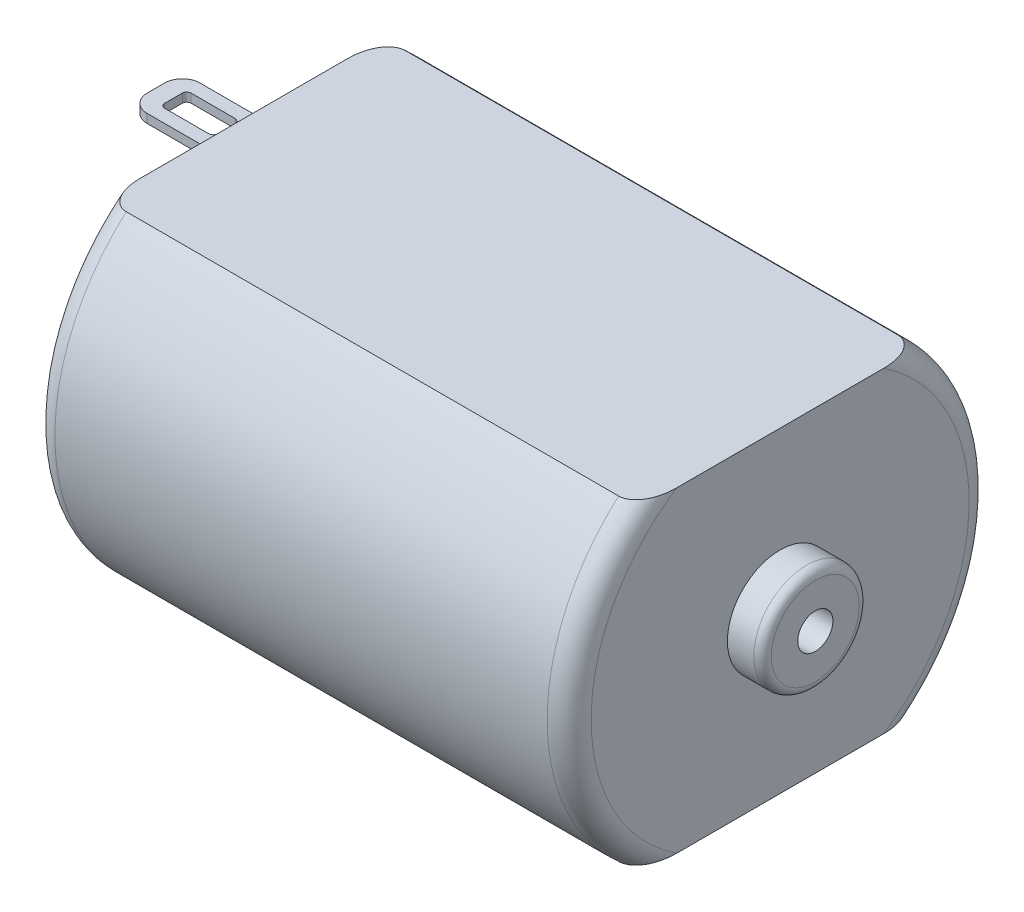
ISO-10303-21;
HEADER;
FILE_DESCRIPTION(('STEP AP214'),'2;1');
FILE_NAME('part.step','',(''),(''),'','','');
FILE_SCHEMA(('AUTOMOTIVE_DESIGN { 1 0 10303 214 1 1 1 1 }'));
ENDSEC;
DATA;
#1=APPLICATION_CONTEXT('core data for automotive mechanical design processes');
#2=APPLICATION_PROTOCOL_DEFINITION('international standard','automotive_design',2000,#1);
#3=PRODUCT_CONTEXT('',#1,'mechanical');
#4=PRODUCT('Part','Part','',(#3));
#5=PRODUCT_RELATED_PRODUCT_CATEGORY('part','',(#4));
#6=PRODUCT_DEFINITION_FORMATION('','',#4);
#7=PRODUCT_DEFINITION_CONTEXT('part definition',#1,'design');
#8=PRODUCT_DEFINITION('design','',#6,#7);
#9=PRODUCT_DEFINITION_SHAPE('','',#8);
#10=(LENGTH_UNIT() NAMED_UNIT(*) SI_UNIT(.MILLI.,.METRE.));
#11=(NAMED_UNIT(*) PLANE_ANGLE_UNIT() SI_UNIT($,.RADIAN.));
#12=(NAMED_UNIT(*) SI_UNIT($,.STERADIAN.) SOLID_ANGLE_UNIT());
#13=UNCERTAINTY_MEASURE_WITH_UNIT(LENGTH_MEASURE(1.E-05),#10,'distance_accuracy_value','');
#14=(GEOMETRIC_REPRESENTATION_CONTEXT(3) GLOBAL_UNCERTAINTY_ASSIGNED_CONTEXT((#13)) GLOBAL_UNIT_ASSIGNED_CONTEXT((#10,
#11,#12)) REPRESENTATION_CONTEXT('',''));
#15=CARTESIAN_POINT('',(0.,0.,0.));
#16=DIRECTION('',(0.,0.,1.));
#17=DIRECTION('',(1.,0.,0.));
#18=AXIS2_PLACEMENT_3D('',#15,#16,#17);
#19=CARTESIAN_POINT('',(-30.5,10.75,0.));
#20=DIRECTION('',(1.,0.,0.));
#21=DIRECTION('',(0.,0.,-1.));
#22=AXIS2_PLACEMENT_3D('',#19,#20,#21);
#23=PLANE('',#22);
#24=DIRECTION('',(0.,0.,-1.));
#25=VECTOR('',#24,1.);
#26=CARTESIAN_POINT('',(-30.5,-7.50000000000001,1.49999999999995));
#27=LINE('',#26,#25);
#28=CARTESIAN_POINT('',(-30.5,-7.50000000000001,1.49999999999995));
#29=VERTEX_POINT('',#28);
#30=CARTESIAN_POINT('',(-30.5,-7.49999999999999,-1.50000000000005));
#31=VERTEX_POINT('',#30);
#32=EDGE_CURVE('E672',#29,#31,#27,.T.);
#33=ORIENTED_EDGE('',*,*,#32,.F.);
#34=DIRECTION('',(0.,1.,0.));
#35=VECTOR('',#34,1.);
#36=CARTESIAN_POINT('',(-30.5,-8.00000000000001,1.49999999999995));
#37=LINE('',#36,#35);
#38=CARTESIAN_POINT('',(-30.5,-8.00000000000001,1.49999999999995));
#39=VERTEX_POINT('',#38);
#40=EDGE_CURVE('E662',#39,#29,#37,.T.);
#41=ORIENTED_EDGE('',*,*,#40,.F.);
#42=DIRECTION('',(0.,0.,1.));
#43=VECTOR('',#42,1.);
#44=CARTESIAN_POINT('',(-30.5,-8.00000000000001,1.49999999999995));
#45=LINE('',#44,#43);
#46=CARTESIAN_POINT('',(-30.5,-7.99999999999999,-1.50000000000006));
#47=VERTEX_POINT('',#46);
#48=EDGE_CURVE('E666',#47,#39,#45,.T.);
#49=ORIENTED_EDGE('',*,*,#48,.F.);
#50=DIRECTION('',(0.,-1.,0.));
#51=VECTOR('',#50,1.);
#52=CARTESIAN_POINT('',(-30.5,-7.99999999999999,-1.50000000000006));
#53=LINE('',#52,#51);
#54=EDGE_CURVE('E669',#31,#47,#53,.T.);
#55=ORIENTED_EDGE('',*,*,#54,.F.);
#56=EDGE_LOOP('',(#33,#41,#49,#55));
#57=FACE_BOUND('',#56,.T.);
#58=CARTESIAN_POINT('',(-30.5,0.,0.));
#59=DIRECTION('',(-1.,0.,0.));
#60=DIRECTION('',(0.,0.,1.));
#61=AXIS2_PLACEMENT_3D('',#58,#59,#60);
#62=CIRCLE('',#61,4.);
#63=CARTESIAN_POINT('',(-30.5,0.,4.));
#64=VERTEX_POINT('',#63);
#65=EDGE_CURVE('E298',#64,#64,#62,.T.);
#66=ORIENTED_EDGE('',*,*,#65,.F.);
#67=EDGE_LOOP('',(#66));
#68=FACE_BOUND('',#67,.T.);
#69=DIRECTION('',(0.,0.,1.));
#70=VECTOR('',#69,1.);
#71=CARTESIAN_POINT('',(-30.5,7.5,-1.5));
#72=LINE('',#71,#70);
#73=CARTESIAN_POINT('',(-30.5,7.5,-1.5));
#74=VERTEX_POINT('',#73);
#75=CARTESIAN_POINT('',(-30.5,7.5,1.5));
#76=VERTEX_POINT('',#75);
#77=EDGE_CURVE('E331',#74,#76,#72,.T.);
#78=ORIENTED_EDGE('',*,*,#77,.F.);
#79=DIRECTION('',(0.,-1.,0.));
#80=VECTOR('',#79,1.);
#81=CARTESIAN_POINT('',(-30.5,8.,-1.5));
#82=LINE('',#81,#80);
#83=CARTESIAN_POINT('',(-30.5,8.,-1.5));
#84=VERTEX_POINT('',#83);
#85=EDGE_CURVE('E559',#84,#74,#82,.T.);
#86=ORIENTED_EDGE('',*,*,#85,.F.);
#87=DIRECTION('',(0.,0.,-1.));
#88=VECTOR('',#87,1.);
#89=CARTESIAN_POINT('',(-30.5,8.,-1.5));
#90=LINE('',#89,#88);
#91=CARTESIAN_POINT('',(-30.5,8.,1.5));
#92=VERTEX_POINT('',#91);
#93=EDGE_CURVE('E562',#92,#84,#90,.T.);
#94=ORIENTED_EDGE('',*,*,#93,.F.);
#95=DIRECTION('',(0.,1.,0.));
#96=VECTOR('',#95,1.);
#97=CARTESIAN_POINT('',(-30.5,8.,1.5));
#98=LINE('',#97,#96);
#99=EDGE_CURVE('E565',#76,#92,#98,.T.);
#100=ORIENTED_EDGE('',*,*,#99,.F.);
#101=EDGE_LOOP('',(#78,#86,#94,#100));
#102=FACE_BOUND('',#101,.T.);
#103=DIRECTION('',(0.,0.,-1.));
#104=VECTOR('',#103,1.);
#105=CARTESIAN_POINT('',(-30.5,-9.,0.));
#106=LINE('',#105,#104);
#107=CARTESIAN_POINT('',(-30.5,-9.,5.87898800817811));
#108=VERTEX_POINT('',#107);
#109=CARTESIAN_POINT('',(-30.5,-9.,-5.87898800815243));
#110=VERTEX_POINT('',#109);
#111=EDGE_CURVE('E334',#108,#110,#106,.T.);
#112=ORIENTED_EDGE('',*,*,#111,.F.);
#113=CARTESIAN_POINT('',(-30.5,0.,0.));
#114=DIRECTION('',(-1.,0.,0.));
#115=DIRECTION('',(0.,0.,1.));
#116=AXIS2_PLACEMENT_3D('',#113,#114,#115);
#117=CIRCLE('',#116,10.75);
#118=CARTESIAN_POINT('',(-30.5,9.,5.87898800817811));
#119=VERTEX_POINT('',#118);
#120=EDGE_CURVE('E294',#108,#119,#117,.T.);
#121=ORIENTED_EDGE('',*,*,#120,.T.);
#122=DIRECTION('',(0.,0.,-1.));
#123=VECTOR('',#122,1.);
#124=CARTESIAN_POINT('',(-30.5,9.,0.));
#125=LINE('',#124,#123);
#126=CARTESIAN_POINT('',(-30.5,9.,-5.87898800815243));
#127=VERTEX_POINT('',#126);
#128=EDGE_CURVE('E353',#119,#127,#125,.T.);
#129=ORIENTED_EDGE('',*,*,#128,.T.);
#130=EDGE_CURVE('E295',#127,#110,#117,.T.);
#131=ORIENTED_EDGE('',*,*,#130,.T.);
#132=EDGE_LOOP('',(#112,#121,#129,#131));
#133=FACE_BOUND('',#132,.T.);
#134=ADVANCED_FACE('F34',(#57,#68,#102,#133),#23,.F.);
#135=CARTESIAN_POINT('',(-29.25,0.,0.));
#136=DIRECTION('',(-1.,0.,0.));
#137=DIRECTION('',(0.,0.,1.));
#138=AXIS2_PLACEMENT_3D('',#135,#136,#137);
#139=TOROIDAL_SURFACE('',#138,10.75,1.25);
#140=CARTESIAN_POINT('',(-29.9168849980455,-9.,-7.64270930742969));
#141=CARTESIAN_POINT('',(-29.8770111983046,-9.,-7.68156463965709));
#142=CARTESIAN_POINT('',(-29.8345880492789,-9.,-7.71786149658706));
#143=CARTESIAN_POINT('',(-29.7447454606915,-9.,-7.78375694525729));
#144=CARTESIAN_POINT('',(-29.6973244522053,-9.,-7.81335342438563));
#145=CARTESIAN_POINT('',(-29.597612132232,-9.,-7.86429766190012));
#146=CARTESIAN_POINT('',(-29.5452799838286,-9.,-7.88556693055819));
#147=CARTESIAN_POINT('',(-29.437517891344,-9.,-7.91770022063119));
#148=CARTESIAN_POINT('',(-29.3820920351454,-9.,-7.92857764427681));
#149=CARTESIAN_POINT('',(-29.2762992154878,-9.,-7.93834675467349));
#150=CARTESIAN_POINT('',(-29.2260395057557,-9.,-7.93841586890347));
#151=CARTESIAN_POINT('',(-29.12633598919,-9.,-7.929495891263));
#152=CARTESIAN_POINT('',(-29.0768921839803,-9.,-7.92050678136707));
#153=CARTESIAN_POINT('',(-28.9832983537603,-9.,-7.89499380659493));
#154=CARTESIAN_POINT('',(-28.9390098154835,-9.,-7.87896782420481));
#155=CARTESIAN_POINT('',(-28.8533254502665,-9.,-7.84052677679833));
#156=CARTESIAN_POINT('',(-28.8119305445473,-9.,-7.81810968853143));
#157=CARTESIAN_POINT('',(-28.715530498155,-9.,-7.75719322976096));
#158=CARTESIAN_POINT('',(-28.6622791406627,-9.,-7.71591653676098));
#159=CARTESIAN_POINT('',(-28.5631092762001,-9.,-7.62533552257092));
#160=CARTESIAN_POINT('',(-28.5172073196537,-9.,-7.57601357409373));
#161=CARTESIAN_POINT('',(-28.4131939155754,-9.,-7.4478297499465));
#162=CARTESIAN_POINT('',(-28.3590626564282,-9.,-7.36575506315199));
#163=CARTESIAN_POINT('',(-28.2641493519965,-9.,-7.19429167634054));
#164=CARTESIAN_POINT('',(-28.2233915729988,-9.,-7.10489004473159));
#165=CARTESIAN_POINT('',(-28.1604468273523,-9.,-6.94014420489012));
#166=CARTESIAN_POINT('',(-28.1361748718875,-9.,-6.86557558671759));
#167=CARTESIAN_POINT('',(-28.0941810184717,-9.,-6.71459964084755));
#168=CARTESIAN_POINT('',(-28.076463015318,-9.,-6.63819124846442));
#169=CARTESIAN_POINT('',(-28.0320212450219,-9.,-6.40706370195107));
#170=CARTESIAN_POINT('',(-28.0140749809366,-9.,-6.25062631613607));
#171=CARTESIAN_POINT('',(-27.9988880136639,-9.,-5.96712383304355));
#172=CARTESIAN_POINT('',(-27.9983345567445,-9.,-5.84018362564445));
#173=CARTESIAN_POINT('',(-28.0081036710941,-9.,-5.58663158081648));
#174=CARTESIAN_POINT('',(-28.0184340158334,-9.,-5.46002004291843));
#175=CARTESIAN_POINT('',(-28.048876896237,-9.,-5.20791208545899));
#176=CARTESIAN_POINT('',(-28.0689970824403,-9.,-5.08241661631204));
#177=CARTESIAN_POINT('',(-28.1183498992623,-9.,-4.83328779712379));
#178=CARTESIAN_POINT('',(-28.1475779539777,-9.,-4.70965354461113));
#179=CARTESIAN_POINT('',(-28.2010673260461,-9.,-4.51551943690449));
#180=CARTESIAN_POINT('',(-28.2223820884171,-9.,-4.44419498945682));
#181=CARTESIAN_POINT('',(-28.2681946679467,-9.,-4.3025786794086));
#182=CARTESIAN_POINT('',(-28.292692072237,-9.,-4.23228668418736));
#183=CARTESIAN_POINT('',(-28.3450097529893,-9.,-4.09313968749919));
#184=CARTESIAN_POINT('',(-28.3728218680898,-9.,-4.02428162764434));
#185=CARTESIAN_POINT('',(-28.4321865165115,-9.,-3.88820953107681));
#186=CARTESIAN_POINT('',(-28.4637377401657,-9.,-3.82099492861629));
#187=CARTESIAN_POINT('',(-28.5303896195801,-9.,-3.69048380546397));
#188=CARTESIAN_POINT('',(-28.5653795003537,-9.,-3.62713110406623));
#189=CARTESIAN_POINT('',(-28.6406571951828,-9.,-3.50345524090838));
#190=CARTESIAN_POINT('',(-28.6809511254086,-9.,-3.44313568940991));
#191=CARTESIAN_POINT('',(-28.7576605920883,-9.,-3.34226483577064));
#192=CARTESIAN_POINT('',(-28.7925235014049,-9.,-3.3005439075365));
#193=CARTESIAN_POINT('',(-28.8674695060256,-9.,-3.22205774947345));
#194=CARTESIAN_POINT('',(-28.9075345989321,-9.,-3.18527628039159));
#195=CARTESIAN_POINT('',(-28.9736007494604,-9.,-3.13606367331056));
#196=CARTESIAN_POINT('',(-28.9971661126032,-9.,-3.12039887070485));
#197=CARTESIAN_POINT('',(-29.0462464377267,-9.,-3.0924582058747));
#198=CARTESIAN_POINT('',(-29.0717589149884,-9.,-3.08017811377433));
#199=CARTESIAN_POINT('',(-29.1205589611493,-9.,-3.06168321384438));
#200=CARTESIAN_POINT('',(-29.1436009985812,-9.,-3.05483263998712));
#201=CARTESIAN_POINT('',(-29.1905088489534,-9.,-3.04511896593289));
#202=CARTESIAN_POINT('',(-29.2143736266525,-9.,-3.04225102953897));
#203=CARTESIAN_POINT('',(-29.2623045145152,-9.,-3.04085128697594));
#204=CARTESIAN_POINT('',(-29.2863710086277,-9.,-3.04233213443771));
#205=CARTESIAN_POINT('',(-29.3338797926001,-9.,-3.04946316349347));
#206=CARTESIAN_POINT('',(-29.3573213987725,-9.,-3.05511773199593));
#207=CARTESIAN_POINT('',(-29.409638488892,-9.,-3.07212097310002));
#208=CARTESIAN_POINT('',(-29.4381265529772,-9.,-3.08464294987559));
#209=CARTESIAN_POINT('',(-29.4927743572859,-9.,-3.1139999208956));
#210=CARTESIAN_POINT('',(-29.5189282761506,-9.,-3.13084531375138));
#211=CARTESIAN_POINT('',(-29.5886330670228,-9.,-3.18188757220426));
#212=CARTESIAN_POINT('',(-29.629763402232,-9.,-3.21933997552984));
#213=CARTESIAN_POINT('',(-29.706567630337,-9.,-3.2994209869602));
#214=CARTESIAN_POINT('',(-29.7422232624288,-9.,-3.34206610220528));
#215=CARTESIAN_POINT('',(-29.8248887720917,-9.,-3.45088356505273));
#216=CARTESIAN_POINT('',(-29.8695416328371,-9.,-3.51882888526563));
#217=CARTESIAN_POINT('',(-29.9525489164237,-9.,-3.65851452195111));
#218=CARTESIAN_POINT('',(-29.9908902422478,-9.,-3.73026233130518));
#219=CARTESIAN_POINT('',(-30.0627197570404,-9.,-3.8766094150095));
#220=CARTESIAN_POINT('',(-30.0961808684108,-9.,-3.95122189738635));
#221=CARTESIAN_POINT('',(-30.1587195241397,-9.,-4.1021675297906));
#222=CARTESIAN_POINT('',(-30.1878005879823,-9.,-4.1784992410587));
#223=CARTESIAN_POINT('',(-30.2626088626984,-9.,-4.39097045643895));
#224=CARTESIAN_POINT('',(-30.3042355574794,-9.,-4.5285677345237));
#225=CARTESIAN_POINT('',(-30.376093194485,-9.,-4.80682062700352));
#226=CARTESIAN_POINT('',(-30.4063126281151,-9.,-4.94747917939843));
#227=CARTESIAN_POINT('',(-30.454713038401,-9.,-5.23008708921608));
#228=CARTESIAN_POINT('',(-30.472958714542,-9.,-5.37202523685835));
#229=CARTESIAN_POINT('',(-30.4964503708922,-9.,-5.65686850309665));
#230=CARTESIAN_POINT('',(-30.5017106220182,-9.,-5.79977238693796));
#231=CARTESIAN_POINT('',(-30.4974407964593,-9.,-6.07716892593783));
#232=CARTESIAN_POINT('',(-30.4887453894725,-9.,-6.21167183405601));
#233=CARTESIAN_POINT('',(-30.4557037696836,-9.,-6.47928791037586));
#234=CARTESIAN_POINT('',(-30.4313157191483,-9.,-6.61239639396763));
#235=CARTESIAN_POINT('',(-30.3802544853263,-9.,-6.80941482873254));
#236=CARTESIAN_POINT('',(-30.3606102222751,-9.,-6.87514694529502));
#237=CARTESIAN_POINT('',(-30.315901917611,-9.,-7.00472906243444));
#238=CARTESIAN_POINT('',(-30.2908352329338,-9.,-7.06857812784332));
#239=CARTESIAN_POINT('',(-30.2068845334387,-9.,-7.2553865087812));
#240=CARTESIAN_POINT('',(-30.1389711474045,-9.,-7.37479148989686));
#241=CARTESIAN_POINT('',(-30.0355741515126,-9.,-7.51147329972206));
#242=CARTESIAN_POINT('',(-30.0132599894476,-9.,-7.53896276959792));
#243=CARTESIAN_POINT('',(-29.9666042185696,-9.,-7.59221767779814));
#244=CARTESIAN_POINT('',(-29.9422608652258,-9.,-7.61798159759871));
#245=CARTESIAN_POINT('',(-29.9168849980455,-9.,-7.64270930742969));
#246=B_SPLINE_CURVE_WITH_KNOTS('',3,(#140,#141,#142,#143,#144,#145,#146,#147,#148,#149,#150,
#151,#152,#153,#154,#155,#156,#157,#158,#159,#160,#161,#162,#163,#164,#165,#166,#167,#168,#169,
#170,#171,#172,#173,#174,#175,#176,#177,#178,#179,#180,#181,#182,#183,#184,#185,#186,#187,#188,
#189,#190,#191,#192,#193,#194,#195,#196,#197,#198,#199,#200,#201,#202,#203,#204,#205,#206,#207,
#208,#209,#210,#211,#212,#213,#214,#215,#216,#217,#218,#219,#220,#221,#222,#223,#224,#225,#226,
#227,#228,#229,#230,#231,#232,#233,#234,#235,#236,#237,#238,#239,#240,#241,#242,#243,#244,#245),
.UNSPECIFIED.,.T.,.F.,(4,2,2,2,2,2,2,2,2,2,2,2,2,2,2,2,2,2,2,2,2,2,2,2,2,2,2,2,2,2,2,2,2,2,2,2,
2,2,2,2,2,2,2,2,2,2,2,2,2,2,2,2,4),(0.,0.166934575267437,0.333921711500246,0.502446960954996,
0.67075457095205,0.820712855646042,0.970671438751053,1.11139896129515,1.25217108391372,
1.45316837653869,1.65461212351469,1.94793491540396,2.24178703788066,2.47671998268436,
2.71179231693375,3.18251648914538,3.56290056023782,3.94355649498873,4.32451038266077,
4.70527318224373,4.92853462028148,5.15176712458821,5.37446092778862,5.59707695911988,
5.8140271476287,6.03122973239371,6.19408023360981,6.35638149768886,6.44107550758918,
6.52566319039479,6.59748148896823,6.66921250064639,6.74115243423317,6.8131680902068,
6.90599577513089,6.99904885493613,7.16499278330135,7.33147872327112,7.57482096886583,
7.81866197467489,8.06380826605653,8.30875651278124,8.73945908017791,9.17059502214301,
9.59938173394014,10.0276970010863,10.431335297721,10.8360542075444,11.0416334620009,
11.2473131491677,11.655061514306,11.7612072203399,11.8674451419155),.UNSPECIFIED.);
#247=CARTESIAN_POINT('',(-29.2500000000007,-9.,-7.93725393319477));
#248=VERTEX_POINT('',#247);
#249=EDGE_CURVE('E340',#110,#248,#246,.T.);
#250=ORIENTED_EDGE('',*,*,#249,.F.);
#251=ORIENTED_EDGE('',*,*,#130,.F.);
#252=CARTESIAN_POINT('',(-29.9168849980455,9.,-7.64270930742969));
#253=CARTESIAN_POINT('',(-29.8770111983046,9.,-7.68156463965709));
#254=CARTESIAN_POINT('',(-29.8345880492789,9.,-7.71786149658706));
#255=CARTESIAN_POINT('',(-29.7447454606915,9.,-7.78375694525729));
#256=CARTESIAN_POINT('',(-29.6973244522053,9.,-7.81335342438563));
#257=CARTESIAN_POINT('',(-29.597612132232,9.,-7.86429766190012));
#258=CARTESIAN_POINT('',(-29.5452799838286,9.,-7.88556693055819));
#259=CARTESIAN_POINT('',(-29.437517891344,9.,-7.91770022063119));
#260=CARTESIAN_POINT('',(-29.3820920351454,9.,-7.92857764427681));
#261=CARTESIAN_POINT('',(-29.2762992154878,9.,-7.93834675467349));
#262=CARTESIAN_POINT('',(-29.2260395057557,9.,-7.93841586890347));
#263=CARTESIAN_POINT('',(-29.12633598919,9.,-7.929495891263));
#264=CARTESIAN_POINT('',(-29.0768921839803,9.,-7.92050678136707));
#265=CARTESIAN_POINT('',(-28.9832983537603,9.,-7.89499380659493));
#266=CARTESIAN_POINT('',(-28.9390098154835,9.,-7.87896782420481));
#267=CARTESIAN_POINT('',(-28.8533254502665,9.,-7.84052677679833));
#268=CARTESIAN_POINT('',(-28.8119305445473,9.,-7.81810968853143));
#269=CARTESIAN_POINT('',(-28.715530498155,9.,-7.75719322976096));
#270=CARTESIAN_POINT('',(-28.6622791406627,9.,-7.71591653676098));
#271=CARTESIAN_POINT('',(-28.5631092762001,9.,-7.62533552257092));
#272=CARTESIAN_POINT('',(-28.5172073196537,9.,-7.57601357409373));
#273=CARTESIAN_POINT('',(-28.4131939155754,9.,-7.4478297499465));
#274=CARTESIAN_POINT('',(-28.3590626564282,9.,-7.36575506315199));
#275=CARTESIAN_POINT('',(-28.2641493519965,9.,-7.19429167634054));
#276=CARTESIAN_POINT('',(-28.2233915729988,9.,-7.10489004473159));
#277=CARTESIAN_POINT('',(-28.1604468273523,9.,-6.94014420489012));
#278=CARTESIAN_POINT('',(-28.1361748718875,9.,-6.86557558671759));
#279=CARTESIAN_POINT('',(-28.0941810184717,9.,-6.71459964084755));
#280=CARTESIAN_POINT('',(-28.076463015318,9.,-6.63819124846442));
#281=CARTESIAN_POINT('',(-28.0320212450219,9.,-6.40706370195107));
#282=CARTESIAN_POINT('',(-28.0140749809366,9.,-6.25062631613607));
#283=CARTESIAN_POINT('',(-27.9988880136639,9.,-5.96712383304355));
#284=CARTESIAN_POINT('',(-27.9983345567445,9.,-5.84018362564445));
#285=CARTESIAN_POINT('',(-28.0081036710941,9.,-5.58663158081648));
#286=CARTESIAN_POINT('',(-28.0184340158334,9.,-5.46002004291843));
#287=CARTESIAN_POINT('',(-28.048876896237,9.,-5.20791208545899));
#288=CARTESIAN_POINT('',(-28.0689970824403,9.,-5.08241661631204));
#289=CARTESIAN_POINT('',(-28.1183498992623,9.,-4.83328779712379));
#290=CARTESIAN_POINT('',(-28.1475779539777,9.,-4.70965354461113));
#291=CARTESIAN_POINT('',(-28.2010673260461,9.,-4.51551943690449));
#292=CARTESIAN_POINT('',(-28.2223820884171,9.,-4.44419498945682));
#293=CARTESIAN_POINT('',(-28.2681946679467,9.,-4.3025786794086));
#294=CARTESIAN_POINT('',(-28.292692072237,9.,-4.23228668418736));
#295=CARTESIAN_POINT('',(-28.3450097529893,9.,-4.09313968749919));
#296=CARTESIAN_POINT('',(-28.3728218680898,9.,-4.02428162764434));
#297=CARTESIAN_POINT('',(-28.4321865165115,9.,-3.88820953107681));
#298=CARTESIAN_POINT('',(-28.4637377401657,9.,-3.82099492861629));
#299=CARTESIAN_POINT('',(-28.5303896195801,9.,-3.69048380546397));
#300=CARTESIAN_POINT('',(-28.5653795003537,9.,-3.62713110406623));
#301=CARTESIAN_POINT('',(-28.6406571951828,9.,-3.50345524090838));
#302=CARTESIAN_POINT('',(-28.6809511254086,9.,-3.44313568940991));
#303=CARTESIAN_POINT('',(-28.7576605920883,9.,-3.34226483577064));
#304=CARTESIAN_POINT('',(-28.7925235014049,9.,-3.3005439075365));
#305=CARTESIAN_POINT('',(-28.8674695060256,9.,-3.22205774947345));
#306=CARTESIAN_POINT('',(-28.9075345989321,9.,-3.18527628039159));
#307=CARTESIAN_POINT('',(-28.9736007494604,9.,-3.13606367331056));
#308=CARTESIAN_POINT('',(-28.9971661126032,9.,-3.12039887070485));
#309=CARTESIAN_POINT('',(-29.0462464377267,9.,-3.0924582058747));
#310=CARTESIAN_POINT('',(-29.0717589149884,9.,-3.08017811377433));
#311=CARTESIAN_POINT('',(-29.1205589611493,9.,-3.06168321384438));
#312=CARTESIAN_POINT('',(-29.1436009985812,9.,-3.05483263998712));
#313=CARTESIAN_POINT('',(-29.1905088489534,9.,-3.04511896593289));
#314=CARTESIAN_POINT('',(-29.2143736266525,9.,-3.04225102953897));
#315=CARTESIAN_POINT('',(-29.2623045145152,9.,-3.04085128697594));
#316=CARTESIAN_POINT('',(-29.2863710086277,9.,-3.04233213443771));
#317=CARTESIAN_POINT('',(-29.3338797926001,9.,-3.04946316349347));
#318=CARTESIAN_POINT('',(-29.3573213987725,9.,-3.05511773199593));
#319=CARTESIAN_POINT('',(-29.409638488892,9.,-3.07212097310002));
#320=CARTESIAN_POINT('',(-29.4381265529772,9.,-3.08464294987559));
#321=CARTESIAN_POINT('',(-29.4927743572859,9.,-3.1139999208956));
#322=CARTESIAN_POINT('',(-29.5189282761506,9.,-3.13084531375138));
#323=CARTESIAN_POINT('',(-29.5886330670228,9.,-3.18188757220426));
#324=CARTESIAN_POINT('',(-29.629763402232,9.,-3.21933997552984));
#325=CARTESIAN_POINT('',(-29.706567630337,9.,-3.2994209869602));
#326=CARTESIAN_POINT('',(-29.7422232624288,9.,-3.34206610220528));
#327=CARTESIAN_POINT('',(-29.8248887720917,9.,-3.45088356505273));
#328=CARTESIAN_POINT('',(-29.8695416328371,9.,-3.51882888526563));
#329=CARTESIAN_POINT('',(-29.9525489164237,9.,-3.65851452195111));
#330=CARTESIAN_POINT('',(-29.9908902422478,9.,-3.73026233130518));
#331=CARTESIAN_POINT('',(-30.0627197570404,9.,-3.8766094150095));
#332=CARTESIAN_POINT('',(-30.0961808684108,9.,-3.95122189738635));
#333=CARTESIAN_POINT('',(-30.1587195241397,9.,-4.1021675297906));
#334=CARTESIAN_POINT('',(-30.1878005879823,9.,-4.1784992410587));
#335=CARTESIAN_POINT('',(-30.2626088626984,9.,-4.39097045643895));
#336=CARTESIAN_POINT('',(-30.3042355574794,9.,-4.5285677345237));
#337=CARTESIAN_POINT('',(-30.376093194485,9.,-4.80682062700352));
#338=CARTESIAN_POINT('',(-30.4063126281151,9.,-4.94747917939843));
#339=CARTESIAN_POINT('',(-30.454713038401,9.,-5.23008708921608));
#340=CARTESIAN_POINT('',(-30.472958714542,9.,-5.37202523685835));
#341=CARTESIAN_POINT('',(-30.4964503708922,9.,-5.65686850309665));
#342=CARTESIAN_POINT('',(-30.5017106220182,9.,-5.79977238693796));
#343=CARTESIAN_POINT('',(-30.4974407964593,9.,-6.07716892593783));
#344=CARTESIAN_POINT('',(-30.4887453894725,9.,-6.21167183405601));
#345=CARTESIAN_POINT('',(-30.4557037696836,9.,-6.47928791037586));
#346=CARTESIAN_POINT('',(-30.4313157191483,9.,-6.61239639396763));
#347=CARTESIAN_POINT('',(-30.3802544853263,9.,-6.80941482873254));
#348=CARTESIAN_POINT('',(-30.3606102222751,9.,-6.87514694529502));
#349=CARTESIAN_POINT('',(-30.315901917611,9.,-7.00472906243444));
#350=CARTESIAN_POINT('',(-30.2908352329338,9.,-7.06857812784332));
#351=CARTESIAN_POINT('',(-30.2068845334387,9.,-7.2553865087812));
#352=CARTESIAN_POINT('',(-30.1389711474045,9.,-7.37479148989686));
#353=CARTESIAN_POINT('',(-30.0355741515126,9.,-7.51147329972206));
#354=CARTESIAN_POINT('',(-30.0132599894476,9.,-7.53896276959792));
#355=CARTESIAN_POINT('',(-29.9666042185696,9.,-7.59221767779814));
#356=CARTESIAN_POINT('',(-29.9422608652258,9.,-7.61798159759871));
#357=CARTESIAN_POINT('',(-29.9168849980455,9.,-7.64270930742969));
#358=B_SPLINE_CURVE_WITH_KNOTS('',3,(#252,#253,#254,#255,#256,#257,#258,#259,#260,#261,#262,
#263,#264,#265,#266,#267,#268,#269,#270,#271,#272,#273,#274,#275,#276,#277,#278,#279,#280,#281,
#282,#283,#284,#285,#286,#287,#288,#289,#290,#291,#292,#293,#294,#295,#296,#297,#298,#299,#300,
#301,#302,#303,#304,#305,#306,#307,#308,#309,#310,#311,#312,#313,#314,#315,#316,#317,#318,#319,
#320,#321,#322,#323,#324,#325,#326,#327,#328,#329,#330,#331,#332,#333,#334,#335,#336,#337,#338,
#339,#340,#341,#342,#343,#344,#345,#346,#347,#348,#349,#350,#351,#352,#353,#354,#355,#356,#357),
.UNSPECIFIED.,.T.,.F.,(4,2,2,2,2,2,2,2,2,2,2,2,2,2,2,2,2,2,2,2,2,2,2,2,2,2,2,2,2,2,2,2,2,2,2,2,
2,2,2,2,2,2,2,2,2,2,2,2,2,2,2,2,4),(0.,0.166934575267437,0.333921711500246,0.502446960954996,
0.67075457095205,0.820712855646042,0.970671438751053,1.11139896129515,1.25217108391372,
1.45316837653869,1.65461212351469,1.94793491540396,2.24178703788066,2.47671998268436,
2.71179231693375,3.18251648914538,3.56290056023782,3.94355649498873,4.32451038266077,
4.70527318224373,4.92853462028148,5.15176712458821,5.37446092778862,5.59707695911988,
5.8140271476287,6.03122973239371,6.19408023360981,6.35638149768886,6.44107550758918,
6.52566319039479,6.59748148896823,6.66921250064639,6.74115243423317,6.8131680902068,
6.90599577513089,6.99904885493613,7.16499278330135,7.33147872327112,7.57482096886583,
7.81866197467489,8.06380826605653,8.30875651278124,8.73945908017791,9.17059502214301,
9.59938173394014,10.0276970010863,10.431335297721,10.8360542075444,11.0416334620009,
11.2473131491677,11.655061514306,11.7612072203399,11.8674451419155),.UNSPECIFIED.);
#359=CARTESIAN_POINT('',(-29.2500000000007,9.,-7.93725393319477));
#360=VERTEX_POINT('',#359);
#361=EDGE_CURVE('E356',#127,#360,#358,.T.);
#362=ORIENTED_EDGE('',*,*,#361,.T.);
#363=CARTESIAN_POINT('',(-29.25,0.,0.));
#364=DIRECTION('',(-1.,0.,0.));
#365=DIRECTION('',(0.,0.,1.));
#366=AXIS2_PLACEMENT_3D('',#363,#364,#365);
#367=CIRCLE('',#366,12.);
#368=EDGE_CURVE('E291',#360,#248,#367,.T.);
#369=ORIENTED_EDGE('',*,*,#368,.T.);
#370=EDGE_LOOP('',(#250,#251,#362,#369));
#371=FACE_BOUND('',#370,.T.);
#372=ADVANCED_FACE('F323',(#371),#139,.T.);
#373=CARTESIAN_POINT('',(-29.1017131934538,-9.,3.06884119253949));
#374=CARTESIAN_POINT('',(-29.0621115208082,-9.,3.08350315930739));
#375=CARTESIAN_POINT('',(-29.0244298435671,-9.,3.10334386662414));
#376=CARTESIAN_POINT('',(-28.9532765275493,-9.,3.14960580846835));
#377=CARTESIAN_POINT('',(-28.9198376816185,-9.,3.17607409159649));
#378=CARTESIAN_POINT('',(-28.8609778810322,-9.,3.22914258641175));
#379=CARTESIAN_POINT('',(-28.8350853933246,-9.,3.25523250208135));
#380=CARTESIAN_POINT('',(-28.7855875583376,-9.,3.30951474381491));
#381=CARTESIAN_POINT('',(-28.761984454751,-9.,3.3377090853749));
#382=CARTESIAN_POINT('',(-28.6940234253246,-9.,3.42450082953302));
#383=CARTESIAN_POINT('',(-28.6525062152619,-9.,3.48531438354));
#384=CARTESIAN_POINT('',(-28.5851889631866,-9.,3.59389741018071));
#385=CARTESIAN_POINT('',(-28.5581198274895,-9.,3.64091338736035));
#386=CARTESIAN_POINT('',(-28.5065199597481,-9.,3.73632566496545));
#387=CARTESIAN_POINT('',(-28.4819894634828,-9.,3.78472209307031));
#388=CARTESIAN_POINT('',(-28.4116001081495,-9.,3.93162333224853));
#389=CARTESIAN_POINT('',(-28.3690251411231,-9.,4.03170240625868));
#390=CARTESIAN_POINT('',(-28.2909924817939,-9.,4.23498537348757));
#391=CARTESIAN_POINT('',(-28.2555627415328,-9.,4.33819978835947));
#392=CARTESIAN_POINT('',(-28.191463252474,-9.,4.54660956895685));
#393=CARTESIAN_POINT('',(-28.1627879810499,-9.,4.65180323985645));
#394=CARTESIAN_POINT('',(-28.1109315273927,-9.,4.86846219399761));
#395=CARTESIAN_POINT('',(-28.0880494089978,-9.,4.97999909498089));
#396=CARTESIAN_POINT('',(-28.0497567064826,-9.,5.20439932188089));
#397=CARTESIAN_POINT('',(-28.0343489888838,-9.,5.31726313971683));
#398=CARTESIAN_POINT('',(-28.0116405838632,-9.,5.54336026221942));
#399=CARTESIAN_POINT('',(-28.0043074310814,-9.,5.65659023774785));
#400=CARTESIAN_POINT('',(-27.9985037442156,-9.,5.8832325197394));
#401=CARTESIAN_POINT('',(-28.000028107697,-9.,5.99664468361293));
#402=CARTESIAN_POINT('',(-28.0140798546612,-9.,6.23988181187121));
#403=CARTESIAN_POINT('',(-28.0282195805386,-9.,6.36962327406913));
#404=CARTESIAN_POINT('',(-28.0721939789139,-9.,6.62664114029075));
#405=CARTESIAN_POINT('',(-28.1020349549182,-9.,6.75391653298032));
#406=CARTESIAN_POINT('',(-28.1734843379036,-9.,6.97984209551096));
#407=CARTESIAN_POINT('',(-28.2119449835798,-9.,7.07947232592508));
#408=CARTESIAN_POINT('',(-28.3037826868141,-9.,7.27164855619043));
#409=CARTESIAN_POINT('',(-28.357123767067,-9.,7.36421096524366));
#410=CARTESIAN_POINT('',(-28.4582719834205,-9.,7.50534201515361));
#411=CARTESIAN_POINT('',(-28.5009290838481,-9.,7.55759169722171));
#412=CARTESIAN_POINT('',(-28.5935915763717,-9.,7.65516191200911));
#413=CARTESIAN_POINT('',(-28.6435875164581,-9.,7.70049120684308));
#414=CARTESIAN_POINT('',(-28.740610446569,-9.,7.77385070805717));
#415=CARTESIAN_POINT('',(-28.7863809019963,-9.,7.8035313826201));
#416=CARTESIAN_POINT('',(-28.8821989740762,-9.,7.85500498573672));
#417=CARTESIAN_POINT('',(-28.9322440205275,-9.,7.87680261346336));
#418=CARTESIAN_POINT('',(-29.0359460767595,-9.,7.91106473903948));
#419=CARTESIAN_POINT('',(-29.0896294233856,-9.,7.92345094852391));
#420=CARTESIAN_POINT('',(-29.1983812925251,-9.,7.93744070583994));
#421=CARTESIAN_POINT('',(-29.25344880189,-9.,7.93905192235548));
#422=CARTESIAN_POINT('',(-29.3554963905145,-9.,7.93188051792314));
#423=CARTESIAN_POINT('',(-29.4025781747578,-9.,7.92445152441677));
#424=CARTESIAN_POINT('',(-29.4948618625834,-9.,7.90194744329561));
#425=CARTESIAN_POINT('',(-29.5400635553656,-9.,7.88687150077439));
#426=CARTESIAN_POINT('',(-29.6285709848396,-9.,7.84960799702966));
#427=CARTESIAN_POINT('',(-29.6718132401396,-9.,7.82727145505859));
#428=CARTESIAN_POINT('',(-29.7547195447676,-9.,7.77677212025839));
#429=CARTESIAN_POINT('',(-29.7943819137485,-9.,7.7486066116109));
#430=CARTESIAN_POINT('',(-29.8910560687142,-9.,7.67045065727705));
#431=CARTESIAN_POINT('',(-29.9453359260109,-9.,7.61707435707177));
#432=CARTESIAN_POINT('',(-30.044744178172,-9.,7.50238106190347));
#433=CARTESIAN_POINT('',(-30.0898483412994,-9.,7.44104372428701));
#434=CARTESIAN_POINT('',(-30.1924827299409,-9.,7.28030110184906));
#435=CARTESIAN_POINT('',(-30.244592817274,-9.,7.17745387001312));
#436=CARTESIAN_POINT('',(-30.3324886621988,-9.,6.96510224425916));
#437=CARTESIAN_POINT('',(-30.3682444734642,-9.,6.8555860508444));
#438=CARTESIAN_POINT('',(-30.4206438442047,-9.,6.65370964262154));
#439=CARTESIAN_POINT('',(-30.4396006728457,-9.,6.56192872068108));
#440=CARTESIAN_POINT('',(-30.4695230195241,-9.,6.37703852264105));
#441=CARTESIAN_POINT('',(-30.4804834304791,-9.,6.2839284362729));
#442=CARTESIAN_POINT('',(-30.4953278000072,-9.,6.09703458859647));
#443=CARTESIAN_POINT('',(-30.4992016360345,-9.,6.00325005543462));
#444=CARTESIAN_POINT('',(-30.5005757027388,-9.,5.81562592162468));
#445=CARTESIAN_POINT('',(-30.4980740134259,-9.,5.72178631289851));
#446=CARTESIAN_POINT('',(-30.4845769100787,-9.,5.48759031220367));
#447=CARTESIAN_POINT('',(-30.4699599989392,-9.,5.34743588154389));
#448=CARTESIAN_POINT('',(-30.4290363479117,-9.,5.06876505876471));
#449=CARTESIAN_POINT('',(-30.4027189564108,-9.,4.93025027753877));
#450=CARTESIAN_POINT('',(-30.3389244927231,-9.,4.6552638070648));
#451=CARTESIAN_POINT('',(-30.3014079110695,-9.,4.51880117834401));
#452=CARTESIAN_POINT('',(-30.2366090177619,-9.,4.31695808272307));
#453=CARTESIAN_POINT('',(-30.213601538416,-9.,4.25018292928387));
#454=CARTESIAN_POINT('',(-30.1645607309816,-9.,4.11775719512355));
#455=CARTESIAN_POINT('',(-30.1385279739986,-9.,4.05210640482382));
#456=CARTESIAN_POINT('',(-30.0838499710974,-9.,3.92389341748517));
#457=CARTESIAN_POINT('',(-30.0552894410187,-9.,3.86129523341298));
#458=CARTESIAN_POINT('',(-29.9944985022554,-9.,3.73780063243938));
#459=CARTESIAN_POINT('',(-29.9622641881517,-9.,3.67690611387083));
#460=CARTESIAN_POINT('',(-29.8936444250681,-9.,3.55814982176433));
#461=CARTESIAN_POINT('',(-29.8572953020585,-9.,3.50026722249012));
#462=CARTESIAN_POINT('',(-29.7790076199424,-9.,3.38847019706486));
#463=CARTESIAN_POINT('',(-29.7370840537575,-9.,3.33454570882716));
#464=CARTESIAN_POINT('',(-29.6645265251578,-9.,3.25471395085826));
#465=CARTESIAN_POINT('',(-29.6364638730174,-9.,3.22649252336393));
#466=CARTESIAN_POINT('',(-29.5770527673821,-9.,3.17367888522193));
#467=CARTESIAN_POINT('',(-29.5457081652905,-9.,3.14908250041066));
#468=CARTESIAN_POINT('',(-29.489000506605,-9.,3.11198508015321));
#469=CARTESIAN_POINT('',(-29.4645866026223,-9.,3.09805372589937));
#470=CARTESIAN_POINT('',(-29.4138902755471,-9.,3.07412584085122));
#471=CARTESIAN_POINT('',(-29.3876113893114,-9.,3.06412208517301));
#472=CARTESIAN_POINT('',(-29.338299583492,-9.,3.0505000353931));
#473=CARTESIAN_POINT('',(-29.3154927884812,-9.,3.04607587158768));
#474=CARTESIAN_POINT('',(-29.2694593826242,-9.,3.04119495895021));
#475=CARTESIAN_POINT('',(-29.2462331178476,-9.,3.04073507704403));
#476=CARTESIAN_POINT('',(-29.2024041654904,-9.,3.04367227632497));
#477=CARTESIAN_POINT('',(-29.1817740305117,-9.,3.04668340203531));
#478=CARTESIAN_POINT('',(-29.1411783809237,-9.,3.05565773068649));
#479=CARTESIAN_POINT('',(-29.121213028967,-9.,3.06162165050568));
#480=CARTESIAN_POINT('',(-29.1017131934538,-9.,3.06884119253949));
#481=B_SPLINE_CURVE_WITH_KNOTS('',3,(#373,#374,#375,#376,#377,#378,#379,#380,#381,#382,#383,
#384,#385,#386,#387,#388,#389,#390,#391,#392,#393,#394,#395,#396,#397,#398,#399,#400,#401,#402,
#403,#404,#405,#406,#407,#408,#409,#410,#411,#412,#413,#414,#415,#416,#417,#418,#419,#420,#421,
#422,#423,#424,#425,#426,#427,#428,#429,#430,#431,#432,#433,#434,#435,#436,#437,#438,#439,#440,
#441,#442,#443,#444,#445,#446,#447,#448,#449,#450,#451,#452,#453,#454,#455,#456,#457,#458,#459,
#460,#461,#462,#463,#464,#465,#466,#467,#468,#469,#470,#471,#472,#473,#474,#475,#476,#477,#478,
#479,#480),.UNSPECIFIED.,.T.,.F.,(4,2,2,2,2,2,2,2,2,2,2,2,2,2,2,2,2,2,2,2,2,2,2,2,2,2,2,2,2,2,2,
2,2,2,2,2,2,2,2,2,2,2,2,2,2,2,2,2,2,2,2,2,2,4),(0.,0.126570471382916,0.254066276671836,
0.364174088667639,0.47438874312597,0.694786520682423,0.857480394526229,1.02018936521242,
1.34608574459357,1.67323329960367,2.00011243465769,2.34144792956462,2.68291422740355,
3.02300252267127,3.36289492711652,3.75364832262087,4.14455871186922,4.46401906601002,
4.78271363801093,4.98448014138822,5.18598902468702,5.34901343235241,5.51194049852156,
5.67620845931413,5.84035949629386,5.98268259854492,6.12502161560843,6.27048815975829,
6.41602263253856,6.64310736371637,6.87078422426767,7.21475128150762,7.55934568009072,
7.84011707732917,8.12106763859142,8.4024192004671,8.68385550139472,9.1060126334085,
9.52855486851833,9.95260576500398,10.1644320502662,10.3762184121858,10.582541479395,
10.7890859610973,10.9939315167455,11.1982368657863,11.3174416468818,11.4365080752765,
11.5205840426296,11.604504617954,11.6738900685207,11.7432206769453,11.8055287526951,
11.867851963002),.UNSPECIFIED.);
#482=CARTESIAN_POINT('',(-29.25,-9.,7.93725393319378));
#483=VERTEX_POINT('',#482);
#484=EDGE_CURVE('E341',#483,#108,#481,.T.);
#485=ORIENTED_EDGE('',*,*,#484,.F.);
#486=CARTESIAN_POINT('',(-29.25,9.,7.93725393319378));
#487=VERTEX_POINT('',#486);
#488=EDGE_CURVE('E290',#483,#487,#367,.T.);
#489=ORIENTED_EDGE('',*,*,#488,.T.);
#490=CARTESIAN_POINT('',(-29.1017131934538,9.,3.06884119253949));
#491=CARTESIAN_POINT('',(-29.0621115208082,9.,3.08350315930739));
#492=CARTESIAN_POINT('',(-29.0244298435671,9.,3.10334386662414));
#493=CARTESIAN_POINT('',(-28.9532765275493,9.,3.14960580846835));
#494=CARTESIAN_POINT('',(-28.9198376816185,9.,3.17607409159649));
#495=CARTESIAN_POINT('',(-28.8609778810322,9.,3.22914258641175));
#496=CARTESIAN_POINT('',(-28.8350853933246,9.,3.25523250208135));
#497=CARTESIAN_POINT('',(-28.7855875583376,9.,3.30951474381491));
#498=CARTESIAN_POINT('',(-28.761984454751,9.,3.3377090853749));
#499=CARTESIAN_POINT('',(-28.6940234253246,9.,3.42450082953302));
#500=CARTESIAN_POINT('',(-28.6525062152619,9.,3.48531438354));
#501=CARTESIAN_POINT('',(-28.5851889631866,9.,3.59389741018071));
#502=CARTESIAN_POINT('',(-28.5581198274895,9.,3.64091338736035));
#503=CARTESIAN_POINT('',(-28.5065199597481,9.,3.73632566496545));
#504=CARTESIAN_POINT('',(-28.4819894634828,9.,3.78472209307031));
#505=CARTESIAN_POINT('',(-28.4116001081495,9.,3.93162333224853));
#506=CARTESIAN_POINT('',(-28.3690251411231,9.,4.03170240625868));
#507=CARTESIAN_POINT('',(-28.2909924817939,9.,4.23498537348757));
#508=CARTESIAN_POINT('',(-28.2555627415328,9.,4.33819978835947));
#509=CARTESIAN_POINT('',(-28.191463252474,9.,4.54660956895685));
#510=CARTESIAN_POINT('',(-28.1627879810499,9.,4.65180323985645));
#511=CARTESIAN_POINT('',(-28.1109315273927,9.,4.86846219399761));
#512=CARTESIAN_POINT('',(-28.0880494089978,9.,4.97999909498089));
#513=CARTESIAN_POINT('',(-28.0497567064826,9.,5.20439932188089));
#514=CARTESIAN_POINT('',(-28.0343489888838,9.,5.31726313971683));
#515=CARTESIAN_POINT('',(-28.0116405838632,9.,5.54336026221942));
#516=CARTESIAN_POINT('',(-28.0043074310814,9.,5.65659023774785));
#517=CARTESIAN_POINT('',(-27.9985037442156,9.,5.8832325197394));
#518=CARTESIAN_POINT('',(-28.000028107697,9.,5.99664468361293));
#519=CARTESIAN_POINT('',(-28.0140798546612,9.,6.23988181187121));
#520=CARTESIAN_POINT('',(-28.0282195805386,9.,6.36962327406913));
#521=CARTESIAN_POINT('',(-28.0721939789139,9.,6.62664114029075));
#522=CARTESIAN_POINT('',(-28.1020349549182,9.,6.75391653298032));
#523=CARTESIAN_POINT('',(-28.1734843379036,9.,6.97984209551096));
#524=CARTESIAN_POINT('',(-28.2119449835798,9.,7.07947232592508));
#525=CARTESIAN_POINT('',(-28.3037826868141,9.,7.27164855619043));
#526=CARTESIAN_POINT('',(-28.357123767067,9.,7.36421096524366));
#527=CARTESIAN_POINT('',(-28.4582719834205,9.,7.50534201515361));
#528=CARTESIAN_POINT('',(-28.5009290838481,9.,7.55759169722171));
#529=CARTESIAN_POINT('',(-28.5935915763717,9.,7.65516191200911));
#530=CARTESIAN_POINT('',(-28.6435875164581,9.,7.70049120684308));
#531=CARTESIAN_POINT('',(-28.740610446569,9.,7.77385070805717));
#532=CARTESIAN_POINT('',(-28.7863809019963,9.,7.8035313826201));
#533=CARTESIAN_POINT('',(-28.8821989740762,9.,7.85500498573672));
#534=CARTESIAN_POINT('',(-28.9322440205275,9.,7.87680261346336));
#535=CARTESIAN_POINT('',(-29.0359460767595,9.,7.91106473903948));
#536=CARTESIAN_POINT('',(-29.0896294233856,9.,7.92345094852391));
#537=CARTESIAN_POINT('',(-29.1983812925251,9.,7.93744070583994));
#538=CARTESIAN_POINT('',(-29.25344880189,9.,7.93905192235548));
#539=CARTESIAN_POINT('',(-29.3554963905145,9.,7.93188051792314));
#540=CARTESIAN_POINT('',(-29.4025781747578,9.,7.92445152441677));
#541=CARTESIAN_POINT('',(-29.4948618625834,9.,7.90194744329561));
#542=CARTESIAN_POINT('',(-29.5400635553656,9.,7.88687150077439));
#543=CARTESIAN_POINT('',(-29.6285709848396,9.,7.84960799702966));
#544=CARTESIAN_POINT('',(-29.6718132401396,9.,7.82727145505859));
#545=CARTESIAN_POINT('',(-29.7547195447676,9.,7.77677212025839));
#546=CARTESIAN_POINT('',(-29.7943819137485,9.,7.7486066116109));
#547=CARTESIAN_POINT('',(-29.8910560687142,9.,7.67045065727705));
#548=CARTESIAN_POINT('',(-29.9453359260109,9.,7.61707435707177));
#549=CARTESIAN_POINT('',(-30.044744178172,9.,7.50238106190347));
#550=CARTESIAN_POINT('',(-30.0898483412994,9.,7.44104372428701));
#551=CARTESIAN_POINT('',(-30.1924827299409,9.,7.28030110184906));
#552=CARTESIAN_POINT('',(-30.244592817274,9.,7.17745387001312));
#553=CARTESIAN_POINT('',(-30.3324886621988,9.,6.96510224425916));
#554=CARTESIAN_POINT('',(-30.3682444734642,9.,6.8555860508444));
#555=CARTESIAN_POINT('',(-30.4206438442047,9.,6.65370964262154));
#556=CARTESIAN_POINT('',(-30.4396006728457,9.,6.56192872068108));
#557=CARTESIAN_POINT('',(-30.4695230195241,9.,6.37703852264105));
#558=CARTESIAN_POINT('',(-30.4804834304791,9.,6.2839284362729));
#559=CARTESIAN_POINT('',(-30.4953278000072,9.,6.09703458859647));
#560=CARTESIAN_POINT('',(-30.4992016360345,9.,6.00325005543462));
#561=CARTESIAN_POINT('',(-30.5005757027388,9.,5.81562592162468));
#562=CARTESIAN_POINT('',(-30.4980740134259,9.,5.72178631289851));
#563=CARTESIAN_POINT('',(-30.4845769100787,9.,5.48759031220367));
#564=CARTESIAN_POINT('',(-30.4699599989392,9.,5.34743588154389));
#565=CARTESIAN_POINT('',(-30.4290363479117,9.,5.06876505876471));
#566=CARTESIAN_POINT('',(-30.4027189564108,9.,4.93025027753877));
#567=CARTESIAN_POINT('',(-30.3389244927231,9.,4.6552638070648));
#568=CARTESIAN_POINT('',(-30.3014079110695,9.,4.51880117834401));
#569=CARTESIAN_POINT('',(-30.2366090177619,9.,4.31695808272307));
#570=CARTESIAN_POINT('',(-30.213601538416,9.,4.25018292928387));
#571=CARTESIAN_POINT('',(-30.1645607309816,9.,4.11775719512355));
#572=CARTESIAN_POINT('',(-30.1385279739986,9.,4.05210640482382));
#573=CARTESIAN_POINT('',(-30.0838499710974,9.,3.92389341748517));
#574=CARTESIAN_POINT('',(-30.0552894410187,9.,3.86129523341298));
#575=CARTESIAN_POINT('',(-29.9944985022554,9.,3.73780063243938));
#576=CARTESIAN_POINT('',(-29.9622641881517,9.,3.67690611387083));
#577=CARTESIAN_POINT('',(-29.8936444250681,9.,3.55814982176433));
#578=CARTESIAN_POINT('',(-29.8572953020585,9.,3.50026722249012));
#579=CARTESIAN_POINT('',(-29.7790076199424,9.,3.38847019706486));
#580=CARTESIAN_POINT('',(-29.7370840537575,9.,3.33454570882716));
#581=CARTESIAN_POINT('',(-29.6645265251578,9.,3.25471395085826));
#582=CARTESIAN_POINT('',(-29.6364638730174,9.,3.22649252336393));
#583=CARTESIAN_POINT('',(-29.5770527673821,9.,3.17367888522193));
#584=CARTESIAN_POINT('',(-29.5457081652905,9.,3.14908250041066));
#585=CARTESIAN_POINT('',(-29.489000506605,9.,3.11198508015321));
#586=CARTESIAN_POINT('',(-29.4645866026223,9.,3.09805372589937));
#587=CARTESIAN_POINT('',(-29.4138902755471,9.,3.07412584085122));
#588=CARTESIAN_POINT('',(-29.3876113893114,9.,3.06412208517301));
#589=CARTESIAN_POINT('',(-29.338299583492,9.,3.0505000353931));
#590=CARTESIAN_POINT('',(-29.3154927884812,9.,3.04607587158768));
#591=CARTESIAN_POINT('',(-29.2694593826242,9.,3.04119495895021));
#592=CARTESIAN_POINT('',(-29.2462331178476,9.,3.04073507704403));
#593=CARTESIAN_POINT('',(-29.2024041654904,9.,3.04367227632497));
#594=CARTESIAN_POINT('',(-29.1817740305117,9.,3.04668340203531));
#595=CARTESIAN_POINT('',(-29.1411783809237,9.,3.05565773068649));
#596=CARTESIAN_POINT('',(-29.121213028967,9.,3.06162165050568));
#597=CARTESIAN_POINT('',(-29.1017131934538,9.,3.06884119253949));
#598=B_SPLINE_CURVE_WITH_KNOTS('',3,(#490,#491,#492,#493,#494,#495,#496,#497,#498,#499,#500,
#501,#502,#503,#504,#505,#506,#507,#508,#509,#510,#511,#512,#513,#514,#515,#516,#517,#518,#519,
#520,#521,#522,#523,#524,#525,#526,#527,#528,#529,#530,#531,#532,#533,#534,#535,#536,#537,#538,
#539,#540,#541,#542,#543,#544,#545,#546,#547,#548,#549,#550,#551,#552,#553,#554,#555,#556,#557,
#558,#559,#560,#561,#562,#563,#564,#565,#566,#567,#568,#569,#570,#571,#572,#573,#574,#575,#576,
#577,#578,#579,#580,#581,#582,#583,#584,#585,#586,#587,#588,#589,#590,#591,#592,#593,#594,#595,
#596,#597),.UNSPECIFIED.,.T.,.F.,(4,2,2,2,2,2,2,2,2,2,2,2,2,2,2,2,2,2,2,2,2,2,2,2,2,2,2,2,2,2,2,
2,2,2,2,2,2,2,2,2,2,2,2,2,2,2,2,2,2,2,2,2,2,4),(0.,0.126570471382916,0.254066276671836,
0.364174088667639,0.47438874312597,0.694786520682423,0.857480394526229,1.02018936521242,
1.34608574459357,1.67323329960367,2.00011243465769,2.34144792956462,2.68291422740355,
3.02300252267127,3.36289492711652,3.75364832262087,4.14455871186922,4.46401906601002,
4.78271363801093,4.98448014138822,5.18598902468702,5.34901343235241,5.51194049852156,
5.67620845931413,5.84035949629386,5.98268259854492,6.12502161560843,6.27048815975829,
6.41602263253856,6.64310736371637,6.87078422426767,7.21475128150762,7.55934568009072,
7.84011707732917,8.12106763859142,8.4024192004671,8.68385550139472,9.1060126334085,
9.52855486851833,9.95260576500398,10.1644320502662,10.3762184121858,10.582541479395,
10.7890859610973,10.9939315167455,11.1982368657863,11.3174416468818,11.4365080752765,
11.5205840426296,11.604504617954,11.6738900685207,11.7432206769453,11.8055287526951,
11.867851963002),.UNSPECIFIED.);
#599=EDGE_CURVE('E349',#487,#119,#598,.T.);
#600=ORIENTED_EDGE('',*,*,#599,.T.);
#601=ORIENTED_EDGE('',*,*,#120,.F.);
#602=EDGE_LOOP('',(#485,#489,#600,#601));
#603=FACE_BOUND('',#602,.T.);
#604=ADVANCED_FACE('F346',(#603),#139,.T.);
#605=CARTESIAN_POINT('',(-35.7244604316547,0.,0.));
#606=DIRECTION('',(-1.,0.,0.));
#607=DIRECTION('',(0.,0.,1.));
#608=AXIS2_PLACEMENT_3D('',#605,#606,#607);
#609=CYLINDRICAL_SURFACE('',#608,12.);
#610=DIRECTION('',(-1.,0.,0.));
#611=VECTOR('',#610,1.);
#612=CARTESIAN_POINT('',(-35.7244604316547,-9.,7.93725393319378));
#613=LINE('',#612,#611);
#614=CARTESIAN_POINT('',(-1.24999999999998,-9.,7.93725393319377));
#615=VERTEX_POINT('',#614);
#616=EDGE_CURVE('E274',#615,#483,#613,.T.);
#617=ORIENTED_EDGE('',*,*,#616,.F.);
#618=CARTESIAN_POINT('',(-1.25,0.,0.));
#619=DIRECTION('',(-1.,0.,0.));
#620=DIRECTION('',(0.,0.,1.));
#621=AXIS2_PLACEMENT_3D('',#618,#619,#620);
#622=CIRCLE('',#621,12.);
#623=CARTESIAN_POINT('',(-1.24999999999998,9.,7.93725393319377));
#624=VERTEX_POINT('',#623);
#625=EDGE_CURVE('E273',#615,#624,#622,.T.);
#626=ORIENTED_EDGE('',*,*,#625,.T.);
#627=DIRECTION('',(-1.,0.,0.));
#628=VECTOR('',#627,1.);
#629=CARTESIAN_POINT('',(-35.7244604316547,9.,7.93725393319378));
#630=LINE('',#629,#628);
#631=EDGE_CURVE('E354',#624,#487,#630,.T.);
#632=ORIENTED_EDGE('',*,*,#631,.T.);
#633=ORIENTED_EDGE('',*,*,#488,.F.);
#634=EDGE_LOOP('',(#617,#626,#632,#633));
#635=FACE_BOUND('',#634,.T.);
#636=ADVANCED_FACE('F405',(#635),#609,.T.);
#637=DIRECTION('',(-1.,0.,0.));
#638=VECTOR('',#637,1.);
#639=CARTESIAN_POINT('',(-35.7244604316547,-9.,-7.93725393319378));
#640=LINE('',#639,#638);
#641=CARTESIAN_POINT('',(-1.25,-9.,-7.93725393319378));
#642=VERTEX_POINT('',#641);
#643=EDGE_CURVE('E422',#248,#642,#640,.F.);
#644=ORIENTED_EDGE('',*,*,#643,.F.);
#645=ORIENTED_EDGE('',*,*,#368,.F.);
#646=DIRECTION('',(-1.,0.,0.));
#647=VECTOR('',#646,1.);
#648=CARTESIAN_POINT('',(-35.7244604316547,9.,-7.93725393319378));
#649=LINE('',#648,#647);
#650=CARTESIAN_POINT('',(-1.25,9.,-7.93725393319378));
#651=VERTEX_POINT('',#650);
#652=EDGE_CURVE('E389',#360,#651,#649,.F.);
#653=ORIENTED_EDGE('',*,*,#652,.T.);
#654=EDGE_CURVE('E287',#651,#642,#622,.T.);
#655=ORIENTED_EDGE('',*,*,#654,.T.);
#656=EDGE_LOOP('',(#644,#645,#653,#655));
#657=FACE_BOUND('',#656,.T.);
#658=ADVANCED_FACE('F402',(#657),#609,.T.);
#659=CARTESIAN_POINT('',(-1.25,0.,0.));
#660=DIRECTION('',(-1.,0.,0.));
#661=DIRECTION('',(0.,0.,1.));
#662=AXIS2_PLACEMENT_3D('',#659,#660,#661);
#663=TOROIDAL_SURFACE('',#662,10.75,1.25);
#664=CARTESIAN_POINT('',(-0.936780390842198,-9.,-7.87683316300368));
#665=CARTESIAN_POINT('',(-0.875410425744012,-9.,-7.8527088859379));
#666=CARTESIAN_POINT('',(-0.8166374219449,-9.,-7.82193512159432));
#667=CARTESIAN_POINT('',(-0.705814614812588,-9.,-7.75001154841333));
#668=CARTESIAN_POINT('',(-0.653783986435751,-9.,-7.7088330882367));
#669=CARTESIAN_POINT('',(-0.544581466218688,-9.,-7.60743752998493));
#670=CARTESIAN_POINT('',(-0.489453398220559,-9.,-7.54504066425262));
#671=CARTESIAN_POINT('',(-0.389847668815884,-9.,-7.41236860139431));
#672=CARTESIAN_POINT('',(-0.34538382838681,-9.,-7.34208335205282));
#673=CARTESIAN_POINT('',(-0.244816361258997,-9.,-7.15755677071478));
#674=CARTESIAN_POINT('',(-0.195128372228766,-9.,-7.03984368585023));
#675=CARTESIAN_POINT('',(-0.114191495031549,-9.,-6.7983719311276));
#676=CARTESIAN_POINT('',(-0.0829734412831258,-9.,-6.67460352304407));
#677=CARTESIAN_POINT('',(-0.0401481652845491,-9.,-6.44700887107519));
#678=CARTESIAN_POINT('',(-0.0260111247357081,-9.,-6.34363685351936));
#679=CARTESIAN_POINT('',(-0.00668584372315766,-9.,-6.13601763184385));
#680=CARTESIAN_POINT('',(-0.00150360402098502,-9.,-6.03176988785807));
#681=CARTESIAN_POINT('',(0.000942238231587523,-9.,-5.8227995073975));
#682=CARTESIAN_POINT('',(-0.00182505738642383,-9.,-5.71807660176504));
#683=CARTESIAN_POINT('',(-0.0145443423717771,-9.,-5.50911804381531));
#684=CARTESIAN_POINT('',(-0.0244942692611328,-9.,-5.40488226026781));
#685=CARTESIAN_POINT('',(-0.055422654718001,-9.,-5.16250216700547));
#686=CARTESIAN_POINT('',(-0.0789773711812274,-9.,-5.02468263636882));
#687=CARTESIAN_POINT('',(-0.137060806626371,-9.,-4.75124762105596));
#688=CARTESIAN_POINT('',(-0.171601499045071,-9.,-4.6156347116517));
#689=CARTESIAN_POINT('',(-0.251500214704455,-9.,-4.34810203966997));
#690=CARTESIAN_POINT('',(-0.29681885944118,-9.,-4.21617074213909));
#691=CARTESIAN_POINT('',(-0.373891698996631,-9.,-4.02202082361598));
#692=CARTESIAN_POINT('',(-0.401076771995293,-9.,-3.95797119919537));
#693=CARTESIAN_POINT('',(-0.458880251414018,-9.,-3.83144916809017));
#694=CARTESIAN_POINT('',(-0.489497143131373,-9.,-3.76897608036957));
#695=CARTESIAN_POINT('',(-0.540746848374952,-9.,-3.67261803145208));
#696=CARTESIAN_POINT('',(-0.560005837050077,-9.,-3.63800054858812));
#697=CARTESIAN_POINT('',(-0.600033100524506,-9.,-3.56963486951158));
#698=CARTESIAN_POINT('',(-0.620801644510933,-9.,-3.53588682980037));
#699=CARTESIAN_POINT('',(-0.664029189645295,-9.,-3.46959940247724));
#700=CARTESIAN_POINT('',(-0.686484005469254,-9.,-3.43705730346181));
#701=CARTESIAN_POINT('',(-0.733438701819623,-9.,-3.37349425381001));
#702=CARTESIAN_POINT('',(-0.757937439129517,-9.,-3.34247246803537));
#703=CARTESIAN_POINT('',(-0.809363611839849,-9.,-3.28260435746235));
#704=CARTESIAN_POINT('',(-0.836285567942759,-9.,-3.25375338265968));
#705=CARTESIAN_POINT('',(-0.89317619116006,-9.,-3.19913225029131));
#706=CARTESIAN_POINT('',(-0.923144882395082,-9.,-3.17336211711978));
#707=CARTESIAN_POINT('',(-0.979696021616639,-9.,-3.1317788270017));
#708=CARTESIAN_POINT('',(-1.00557348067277,-9.,-3.11502233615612));
#709=CARTESIAN_POINT('',(-1.05962167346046,-9.,-3.08572798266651));
#710=CARTESIAN_POINT('',(-1.08778665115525,-9.,-3.07317991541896));
#711=CARTESIAN_POINT('',(-1.13917447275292,-9.,-3.05610567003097));
#712=CARTESIAN_POINT('',(-1.16199471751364,-9.,-3.05038513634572));
#713=CARTESIAN_POINT('',(-1.20827258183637,-9.,-3.04289065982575));
#714=CARTESIAN_POINT('',(-1.23172951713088,-9.,-3.04111263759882));
#715=CARTESIAN_POINT('',(-1.27861560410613,-9.,-3.04171675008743));
#716=CARTESIAN_POINT('',(-1.3020446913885,-9.,-3.04410374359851));
#717=CARTESIAN_POINT('',(-1.34817682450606,-9.,-3.05275453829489));
#718=CARTESIAN_POINT('',(-1.37087902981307,-9.,-3.05902266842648));
#719=CARTESIAN_POINT('',(-1.42330267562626,-9.,-3.07773566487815));
#720=CARTESIAN_POINT('',(-1.45250776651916,-9.,-3.09160868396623));
#721=CARTESIAN_POINT('',(-1.50839948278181,-9.,-3.12371942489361));
#722=CARTESIAN_POINT('',(-1.53507926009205,-9.,-3.14196856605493));
#723=CARTESIAN_POINT('',(-1.60733674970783,-9.,-3.19786180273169));
#724=CARTESIAN_POINT('',(-1.65016407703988,-9.,-3.23900781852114));
#725=CARTESIAN_POINT('',(-1.72993921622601,-9.,-3.32659110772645));
#726=CARTESIAN_POINT('',(-1.76686721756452,-9.,-3.37304534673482));
#727=CARTESIAN_POINT('',(-1.85292481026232,-9.,-3.49211341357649));
#728=CARTESIAN_POINT('',(-1.89943335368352,-9.,-3.56660486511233));
#729=CARTESIAN_POINT('',(-1.98560842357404,-9.,-3.71949930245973));
#730=CARTESIAN_POINT('',(-2.02526087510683,-9.,-3.79790991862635));
#731=CARTESIAN_POINT('',(-2.09922616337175,-9.,-3.95768502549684));
#732=CARTESIAN_POINT('',(-2.1335105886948,-9.,-4.03906259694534));
#733=CARTESIAN_POINT('',(-2.19721021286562,-9.,-4.203602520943));
#734=CARTESIAN_POINT('',(-2.22662929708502,-9.,-4.28676338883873));
#735=CARTESIAN_POINT('',(-2.29794845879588,-9.,-4.50674832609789));
#736=CARTESIAN_POINT('',(-2.33622178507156,-9.,-4.64476045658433));
#737=CARTESIAN_POINT('',(-2.40141535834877,-9.,-4.92355729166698));
#738=CARTESIAN_POINT('',(-2.42832498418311,-9.,-5.0643444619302));
#739=CARTESIAN_POINT('',(-2.46995779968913,-9.,-5.34700583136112));
#740=CARTESIAN_POINT('',(-2.48474227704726,-9.,-5.48887085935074));
#741=CARTESIAN_POINT('',(-2.50094703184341,-9.,-5.7732579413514));
#742=CARTESIAN_POINT('',(-2.50238277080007,-9.,-5.91577904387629));
#743=CARTESIAN_POINT('',(-2.49022467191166,-9.,-6.19006760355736));
#744=CARTESIAN_POINT('',(-2.4776937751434,-9.,-6.32187814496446));
#745=CARTESIAN_POINT('',(-2.4368204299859,-9.,-6.58321097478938));
#746=CARTESIAN_POINT('',(-2.40847637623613,-9.,-6.71273302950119));
#747=CARTESIAN_POINT('',(-2.33924376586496,-9.,-6.94422893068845));
#748=CARTESIAN_POINT('',(-2.30137488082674,-9.,-7.04709125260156));
#749=CARTESIAN_POINT('',(-2.21017587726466,-9.,-7.24577597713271));
#750=CARTESIAN_POINT('',(-2.15688243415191,-9.,-7.34161441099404));
#751=CARTESIAN_POINT('',(-2.05576300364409,-9.,-7.48717520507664));
#752=CARTESIAN_POINT('',(-2.01341141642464,-9.,-7.5406911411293));
#753=CARTESIAN_POINT('',(-1.9212163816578,-9.,-7.64087678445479));
#754=CARTESIAN_POINT('',(-1.87138264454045,-9.,-7.68755521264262));
#755=CARTESIAN_POINT('',(-1.7744871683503,-9.,-7.76338394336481));
#756=CARTESIAN_POINT('',(-1.72872173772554,-9.,-7.7941790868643));
#757=CARTESIAN_POINT('',(-1.63273477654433,-9.,-7.84788480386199));
#758=CARTESIAN_POINT('',(-1.58251578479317,-9.,-7.87079983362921));
#759=CARTESIAN_POINT('',(-1.47822730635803,-9.,-7.90724036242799));
#760=CARTESIAN_POINT('',(-1.42412804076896,-9.,-7.92068217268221));
#761=CARTESIAN_POINT('',(-1.31434517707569,-9.,-7.93658542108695));
#762=CARTESIAN_POINT('',(-1.25866307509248,-9.,-7.93905690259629));
#763=CARTESIAN_POINT('',(-1.15769323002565,-9.,-7.93336240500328));
#764=CARTESIAN_POINT('',(-1.11229475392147,-9.,-7.92698552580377));
#765=CARTESIAN_POINT('',(-1.02310816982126,-9.,-7.90708274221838));
#766=CARTESIAN_POINT('',(-0.979320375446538,-9.,-7.89355545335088));
#767=CARTESIAN_POINT('',(-0.936780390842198,-9.,-7.87683316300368));
#768=B_SPLINE_CURVE_WITH_KNOTS('',3,(#664,#665,#666,#667,#668,#669,#670,#671,#672,#673,#674,
#675,#676,#677,#678,#679,#680,#681,#682,#683,#684,#685,#686,#687,#688,#689,#690,#691,#692,#693,
#694,#695,#696,#697,#698,#699,#700,#701,#702,#703,#704,#705,#706,#707,#708,#709,#710,#711,#712,
#713,#714,#715,#716,#717,#718,#719,#720,#721,#722,#723,#724,#725,#726,#727,#728,#729,#730,#731,
#732,#733,#734,#735,#736,#737,#738,#739,#740,#741,#742,#743,#744,#745,#746,#747,#748,#749,#750,
#751,#752,#753,#754,#755,#756,#757,#758,#759,#760,#761,#762,#763,#764,#765,#766,#767),
.UNSPECIFIED.,.T.,.F.,(4,2,2,2,2,2,2,2,2,2,2,2,2,2,2,2,2,2,2,2,2,2,2,2,2,2,2,2,2,2,2,2,2,2,2,2,
2,2,2,2,2,2,2,2,2,2,2,2,2,2,2,4),(0.,0.197582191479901,0.395714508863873,0.644106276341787,
0.892818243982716,1.27400988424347,1.65583611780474,1.96841411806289,2.28120150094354,
2.59520626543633,2.9091208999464,3.32807688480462,3.74749105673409,4.16539577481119,
4.37406301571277,4.5826385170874,4.70145112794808,4.82028497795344,4.9388330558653,
5.05731526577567,5.17553599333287,5.29375765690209,5.38597685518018,5.47797079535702,
5.54825123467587,5.61845891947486,5.6887485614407,5.75911674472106,5.85556092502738,
5.95225956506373,6.12943075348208,6.30718493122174,6.57002820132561,6.83340481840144,
7.09813144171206,7.36264562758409,7.79177705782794,8.22130869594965,8.64865560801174,
9.07550747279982,9.47196421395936,9.86846121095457,10.1963435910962,10.5234526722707,
10.7276089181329,10.9315024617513,11.0963550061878,11.261114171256,11.4273112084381,
11.5933560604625,11.7302881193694,11.8672467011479),.UNSPECIFIED.);
#769=CARTESIAN_POINT('',(0.,-9.,-5.87898800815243));
#770=VERTEX_POINT('',#769);
#771=EDGE_CURVE('E48',#642,#770,#768,.T.);
#772=ORIENTED_EDGE('',*,*,#771,.F.);
#773=ORIENTED_EDGE('',*,*,#654,.F.);
#774=CARTESIAN_POINT('',(-0.936780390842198,9.,-7.87683316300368));
#775=CARTESIAN_POINT('',(-0.875410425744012,9.,-7.8527088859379));
#776=CARTESIAN_POINT('',(-0.8166374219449,9.,-7.82193512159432));
#777=CARTESIAN_POINT('',(-0.705814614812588,9.,-7.75001154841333));
#778=CARTESIAN_POINT('',(-0.653783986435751,9.,-7.7088330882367));
#779=CARTESIAN_POINT('',(-0.544581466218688,9.,-7.60743752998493));
#780=CARTESIAN_POINT('',(-0.489453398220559,9.,-7.54504066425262));
#781=CARTESIAN_POINT('',(-0.389847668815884,9.,-7.41236860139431));
#782=CARTESIAN_POINT('',(-0.34538382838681,9.,-7.34208335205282));
#783=CARTESIAN_POINT('',(-0.244816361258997,9.,-7.15755677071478));
#784=CARTESIAN_POINT('',(-0.195128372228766,9.,-7.03984368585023));
#785=CARTESIAN_POINT('',(-0.114191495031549,9.,-6.7983719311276));
#786=CARTESIAN_POINT('',(-0.0829734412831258,9.,-6.67460352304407));
#787=CARTESIAN_POINT('',(-0.0401481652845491,9.,-6.44700887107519));
#788=CARTESIAN_POINT('',(-0.0260111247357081,9.,-6.34363685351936));
#789=CARTESIAN_POINT('',(-0.00668584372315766,9.,-6.13601763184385));
#790=CARTESIAN_POINT('',(-0.00150360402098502,9.,-6.03176988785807));
#791=CARTESIAN_POINT('',(0.000942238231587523,9.,-5.8227995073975));
#792=CARTESIAN_POINT('',(-0.00182505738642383,9.,-5.71807660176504));
#793=CARTESIAN_POINT('',(-0.0145443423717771,9.,-5.50911804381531));
#794=CARTESIAN_POINT('',(-0.0244942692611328,9.,-5.40488226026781));
#795=CARTESIAN_POINT('',(-0.055422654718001,9.,-5.16250216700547));
#796=CARTESIAN_POINT('',(-0.0789773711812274,9.,-5.02468263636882));
#797=CARTESIAN_POINT('',(-0.137060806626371,9.,-4.75124762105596));
#798=CARTESIAN_POINT('',(-0.171601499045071,9.,-4.6156347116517));
#799=CARTESIAN_POINT('',(-0.251500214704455,9.,-4.34810203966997));
#800=CARTESIAN_POINT('',(-0.29681885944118,9.,-4.21617074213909));
#801=CARTESIAN_POINT('',(-0.373891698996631,9.,-4.02202082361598));
#802=CARTESIAN_POINT('',(-0.401076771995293,9.,-3.95797119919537));
#803=CARTESIAN_POINT('',(-0.458880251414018,9.,-3.83144916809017));
#804=CARTESIAN_POINT('',(-0.489497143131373,9.,-3.76897608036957));
#805=CARTESIAN_POINT('',(-0.540746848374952,9.,-3.67261803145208));
#806=CARTESIAN_POINT('',(-0.560005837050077,9.,-3.63800054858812));
#807=CARTESIAN_POINT('',(-0.600033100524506,9.,-3.56963486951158));
#808=CARTESIAN_POINT('',(-0.620801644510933,9.,-3.53588682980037));
#809=CARTESIAN_POINT('',(-0.664029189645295,9.,-3.46959940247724));
#810=CARTESIAN_POINT('',(-0.686484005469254,9.,-3.43705730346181));
#811=CARTESIAN_POINT('',(-0.733438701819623,9.,-3.37349425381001));
#812=CARTESIAN_POINT('',(-0.757937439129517,9.,-3.34247246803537));
#813=CARTESIAN_POINT('',(-0.809363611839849,9.,-3.28260435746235));
#814=CARTESIAN_POINT('',(-0.836285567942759,9.,-3.25375338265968));
#815=CARTESIAN_POINT('',(-0.89317619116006,9.,-3.19913225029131));
#816=CARTESIAN_POINT('',(-0.923144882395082,9.,-3.17336211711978));
#817=CARTESIAN_POINT('',(-0.979696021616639,9.,-3.1317788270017));
#818=CARTESIAN_POINT('',(-1.00557348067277,9.,-3.11502233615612));
#819=CARTESIAN_POINT('',(-1.05962167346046,9.,-3.08572798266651));
#820=CARTESIAN_POINT('',(-1.08778665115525,9.,-3.07317991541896));
#821=CARTESIAN_POINT('',(-1.13917447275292,9.,-3.05610567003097));
#822=CARTESIAN_POINT('',(-1.16199471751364,9.,-3.05038513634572));
#823=CARTESIAN_POINT('',(-1.20827258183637,9.,-3.04289065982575));
#824=CARTESIAN_POINT('',(-1.23172951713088,9.,-3.04111263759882));
#825=CARTESIAN_POINT('',(-1.27861560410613,9.,-3.04171675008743));
#826=CARTESIAN_POINT('',(-1.3020446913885,9.,-3.04410374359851));
#827=CARTESIAN_POINT('',(-1.34817682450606,9.,-3.05275453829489));
#828=CARTESIAN_POINT('',(-1.37087902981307,9.,-3.05902266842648));
#829=CARTESIAN_POINT('',(-1.42330267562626,9.,-3.07773566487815));
#830=CARTESIAN_POINT('',(-1.45250776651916,9.,-3.09160868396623));
#831=CARTESIAN_POINT('',(-1.50839948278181,9.,-3.12371942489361));
#832=CARTESIAN_POINT('',(-1.53507926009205,9.,-3.14196856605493));
#833=CARTESIAN_POINT('',(-1.60733674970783,9.,-3.19786180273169));
#834=CARTESIAN_POINT('',(-1.65016407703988,9.,-3.23900781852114));
#835=CARTESIAN_POINT('',(-1.72993921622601,9.,-3.32659110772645));
#836=CARTESIAN_POINT('',(-1.76686721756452,9.,-3.37304534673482));
#837=CARTESIAN_POINT('',(-1.85292481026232,9.,-3.49211341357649));
#838=CARTESIAN_POINT('',(-1.89943335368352,9.,-3.56660486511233));
#839=CARTESIAN_POINT('',(-1.98560842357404,9.,-3.71949930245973));
#840=CARTESIAN_POINT('',(-2.02526087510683,9.,-3.79790991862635));
#841=CARTESIAN_POINT('',(-2.09922616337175,9.,-3.95768502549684));
#842=CARTESIAN_POINT('',(-2.1335105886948,9.,-4.03906259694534));
#843=CARTESIAN_POINT('',(-2.19721021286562,9.,-4.203602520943));
#844=CARTESIAN_POINT('',(-2.22662929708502,9.,-4.28676338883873));
#845=CARTESIAN_POINT('',(-2.29794845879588,9.,-4.50674832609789));
#846=CARTESIAN_POINT('',(-2.33622178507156,9.,-4.64476045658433));
#847=CARTESIAN_POINT('',(-2.40141535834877,9.,-4.92355729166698));
#848=CARTESIAN_POINT('',(-2.42832498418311,9.,-5.0643444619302));
#849=CARTESIAN_POINT('',(-2.46995779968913,9.,-5.34700583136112));
#850=CARTESIAN_POINT('',(-2.48474227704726,9.,-5.48887085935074));
#851=CARTESIAN_POINT('',(-2.50094703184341,9.,-5.7732579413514));
#852=CARTESIAN_POINT('',(-2.50238277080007,9.,-5.91577904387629));
#853=CARTESIAN_POINT('',(-2.49022467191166,9.,-6.19006760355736));
#854=CARTESIAN_POINT('',(-2.4776937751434,9.,-6.32187814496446));
#855=CARTESIAN_POINT('',(-2.4368204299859,9.,-6.58321097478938));
#856=CARTESIAN_POINT('',(-2.40847637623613,9.,-6.71273302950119));
#857=CARTESIAN_POINT('',(-2.33924376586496,9.,-6.94422893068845));
#858=CARTESIAN_POINT('',(-2.30137488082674,9.,-7.04709125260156));
#859=CARTESIAN_POINT('',(-2.21017587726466,9.,-7.24577597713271));
#860=CARTESIAN_POINT('',(-2.15688243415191,9.,-7.34161441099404));
#861=CARTESIAN_POINT('',(-2.05576300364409,9.,-7.48717520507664));
#862=CARTESIAN_POINT('',(-2.01341141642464,9.,-7.5406911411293));
#863=CARTESIAN_POINT('',(-1.9212163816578,9.,-7.64087678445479));
#864=CARTESIAN_POINT('',(-1.87138264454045,9.,-7.68755521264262));
#865=CARTESIAN_POINT('',(-1.7744871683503,9.,-7.76338394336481));
#866=CARTESIAN_POINT('',(-1.72872173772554,9.,-7.7941790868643));
#867=CARTESIAN_POINT('',(-1.63273477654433,9.,-7.84788480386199));
#868=CARTESIAN_POINT('',(-1.58251578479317,9.,-7.87079983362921));
#869=CARTESIAN_POINT('',(-1.47822730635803,9.,-7.90724036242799));
#870=CARTESIAN_POINT('',(-1.42412804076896,9.,-7.92068217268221));
#871=CARTESIAN_POINT('',(-1.31434517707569,9.,-7.93658542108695));
#872=CARTESIAN_POINT('',(-1.25866307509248,9.,-7.93905690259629));
#873=CARTESIAN_POINT('',(-1.15769323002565,9.,-7.93336240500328));
#874=CARTESIAN_POINT('',(-1.11229475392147,9.,-7.92698552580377));
#875=CARTESIAN_POINT('',(-1.02310816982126,9.,-7.90708274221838));
#876=CARTESIAN_POINT('',(-0.979320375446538,9.,-7.89355545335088));
#877=CARTESIAN_POINT('',(-0.936780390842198,9.,-7.87683316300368));
#878=B_SPLINE_CURVE_WITH_KNOTS('',3,(#774,#775,#776,#777,#778,#779,#780,#781,#782,#783,#784,
#785,#786,#787,#788,#789,#790,#791,#792,#793,#794,#795,#796,#797,#798,#799,#800,#801,#802,#803,
#804,#805,#806,#807,#808,#809,#810,#811,#812,#813,#814,#815,#816,#817,#818,#819,#820,#821,#822,
#823,#824,#825,#826,#827,#828,#829,#830,#831,#832,#833,#834,#835,#836,#837,#838,#839,#840,#841,
#842,#843,#844,#845,#846,#847,#848,#849,#850,#851,#852,#853,#854,#855,#856,#857,#858,#859,#860,
#861,#862,#863,#864,#865,#866,#867,#868,#869,#870,#871,#872,#873,#874,#875,#876,#877),
.UNSPECIFIED.,.T.,.F.,(4,2,2,2,2,2,2,2,2,2,2,2,2,2,2,2,2,2,2,2,2,2,2,2,2,2,2,2,2,2,2,2,2,2,2,2,
2,2,2,2,2,2,2,2,2,2,2,2,2,2,2,4),(0.,0.197582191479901,0.395714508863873,0.644106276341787,
0.892818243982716,1.27400988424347,1.65583611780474,1.96841411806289,2.28120150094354,
2.59520626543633,2.9091208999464,3.32807688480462,3.74749105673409,4.16539577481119,
4.37406301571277,4.5826385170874,4.70145112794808,4.82028497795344,4.9388330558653,
5.05731526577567,5.17553599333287,5.29375765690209,5.38597685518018,5.47797079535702,
5.54825123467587,5.61845891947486,5.6887485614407,5.75911674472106,5.85556092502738,
5.95225956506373,6.12943075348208,6.30718493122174,6.57002820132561,6.83340481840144,
7.09813144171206,7.36264562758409,7.79177705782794,8.22130869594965,8.64865560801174,
9.07550747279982,9.47196421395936,9.86846121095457,10.1963435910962,10.5234526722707,
10.7276089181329,10.9315024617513,11.0963550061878,11.261114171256,11.4273112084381,
11.5933560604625,11.7302881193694,11.8672467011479),.UNSPECIFIED.);
#879=CARTESIAN_POINT('',(0.,9.,-5.87898800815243));
#880=VERTEX_POINT('',#879);
#881=EDGE_CURVE('E391',#651,#880,#878,.T.);
#882=ORIENTED_EDGE('',*,*,#881,.T.);
#883=CARTESIAN_POINT('',(0.,0.,0.));
#884=DIRECTION('',(-1.,0.,0.));
#885=DIRECTION('',(0.,0.,1.));
#886=AXIS2_PLACEMENT_3D('',#883,#884,#885);
#887=CIRCLE('',#886,10.75);
#888=EDGE_CURVE('E279',#880,#770,#887,.T.);
#889=ORIENTED_EDGE('',*,*,#888,.T.);
#890=EDGE_LOOP('',(#772,#773,#882,#889));
#891=FACE_BOUND('',#890,.T.);
#892=ADVANCED_FACE('F398',(#891),#663,.T.);
#893=CARTESIAN_POINT('',(-1.39828680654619,-9.,3.0688411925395));
#894=CARTESIAN_POINT('',(-1.37609647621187,-9.,3.06062705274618));
#895=CARTESIAN_POINT('',(-1.35329841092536,-9.,3.05403591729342));
#896=CARTESIAN_POINT('',(-1.30691345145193,-9.,3.0447592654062));
#897=CARTESIAN_POINT('',(-1.28332723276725,-9.,3.04207048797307));
#898=CARTESIAN_POINT('',(-1.23598953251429,-9.,3.04092514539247));
#899=CARTESIAN_POINT('',(-1.21223778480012,-9.,3.04247921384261));
#900=CARTESIAN_POINT('',(-1.16535529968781,-9.,3.04964287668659));
#901=CARTESIAN_POINT('',(-1.14222514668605,-9.,3.05525615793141));
#902=CARTESIAN_POINT('',(-1.09019269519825,-9.,3.07218761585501));
#903=CARTESIAN_POINT('',(-1.06169359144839,-9.,3.08472687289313));
#904=CARTESIAN_POINT('',(-1.00702480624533,-9.,3.11412067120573));
#905=CARTESIAN_POINT('',(-0.98086114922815,-9.,3.13098596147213));
#906=CARTESIAN_POINT('',(-0.911120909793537,-9.,3.18209227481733));
#907=CARTESIAN_POINT('',(-0.869968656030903,-9.,3.21959166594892));
#908=CARTESIAN_POINT('',(-0.793126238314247,-9.,3.29976797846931));
#909=CARTESIAN_POINT('',(-0.757454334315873,-9.,3.3424613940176));
#910=CARTESIAN_POINT('',(-0.674740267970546,-9.,3.45141503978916));
#911=CARTESIAN_POINT('',(-0.630059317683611,-9.,3.51945025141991));
#912=CARTESIAN_POINT('',(-0.547003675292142,-9.,3.65931766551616));
#913=CARTESIAN_POINT('',(-0.508642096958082,-9.,3.73115736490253));
#914=CARTESIAN_POINT('',(-0.436783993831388,-9.,3.87767929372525));
#915=CARTESIAN_POINT('',(-0.403313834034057,-9.,3.95237437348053));
#916=CARTESIAN_POINT('',(-0.340762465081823,-9.,4.1034857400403));
#917=CARTESIAN_POINT('',(-0.311677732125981,-9.,4.17990058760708));
#918=CARTESIAN_POINT('',(-0.236934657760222,-9.,4.39241096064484));
#919=CARTESIAN_POINT('',(-0.195365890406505,-9.,4.52995888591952));
#920=CARTESIAN_POINT('',(-0.123614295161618,-9.,4.80810651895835));
#921=CARTESIAN_POINT('',(-0.0934429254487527,-9.,4.9487091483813));
#922=CARTESIAN_POINT('',(-0.045106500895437,-9.,5.23133889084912));
#923=CARTESIAN_POINT('',(-0.0268881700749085,-9.,5.37335677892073));
#924=CARTESIAN_POINT('',(-0.00347080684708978,-9.,5.6583538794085));
#925=CARTESIAN_POINT('',(0.00174235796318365,-9.,5.80133187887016));
#926=CARTESIAN_POINT('',(-0.00274693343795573,-9.,6.08573568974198));
#927=CARTESIAN_POINT('',(-0.0123056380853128,-9.,6.22716314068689));
#928=CARTESIAN_POINT('',(-0.0488402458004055,-9.,6.50790926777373));
#929=CARTESIAN_POINT('',(-0.0758109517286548,-9.,6.64722856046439));
#930=CARTESIAN_POINT('',(-0.142989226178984,-9.,6.89106448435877));
#931=CARTESIAN_POINT('',(-0.179157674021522,-9.,6.99667723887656));
#932=CARTESIAN_POINT('',(-0.267117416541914,-9.,7.2012516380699));
#933=CARTESIAN_POINT('',(-0.318874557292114,-9.,7.30022725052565));
#934=CARTESIAN_POINT('',(-0.418288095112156,-9.,7.45210416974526));
#935=CARTESIAN_POINT('',(-0.460470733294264,-9.,7.50857784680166));
#936=CARTESIAN_POINT('',(-0.552754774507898,-9.,7.61468572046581));
#937=CARTESIAN_POINT('',(-0.602845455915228,-9.,7.66432900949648));
#938=CARTESIAN_POINT('',(-0.700074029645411,-9.,7.74487850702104));
#939=CARTESIAN_POINT('',(-0.745745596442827,-9.,7.77754246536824));
#940=CARTESIAN_POINT('',(-0.841834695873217,-9.,7.83502145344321));
#941=CARTESIAN_POINT('',(-0.892249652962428,-9.,7.8598407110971));
#942=CARTESIAN_POINT('',(-0.99732593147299,-9.,7.9000332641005));
#943=CARTESIAN_POINT('',(-1.05202273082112,-9.,7.91531552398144));
#944=CARTESIAN_POINT('',(-1.16336637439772,-9.,7.93460863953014));
#945=CARTESIAN_POINT('',(-1.22001124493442,-9.,7.93863058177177));
#946=CARTESIAN_POINT('',(-1.32444309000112,-9.,7.93530034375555));
#947=CARTESIAN_POINT('',(-1.37228904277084,-9.,7.92955775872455));
#948=CARTESIAN_POINT('',(-1.46631817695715,-9.,7.91009973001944));
#949=CARTESIAN_POINT('',(-1.51250122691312,-9.,7.89638365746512));
#950=CARTESIAN_POINT('',(-1.60211759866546,-9.,7.86188111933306));
#951=CARTESIAN_POINT('',(-1.64555038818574,-9.,7.84109329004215));
#952=CARTESIAN_POINT('',(-1.7290037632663,-9.,7.79357679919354));
#953=CARTESIAN_POINT('',(-1.76902293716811,-9.,7.76684569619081));
#954=CARTESIAN_POINT('',(-1.86559248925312,-9.,7.69308039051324));
#955=CARTESIAN_POINT('',(-1.91966315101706,-9.,7.64279427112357));
#956=CARTESIAN_POINT('',(-2.01911788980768,-9.,7.53424964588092));
#957=CARTESIAN_POINT('',(-2.06447913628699,-9.,7.47597085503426));
#958=CARTESIAN_POINT('',(-2.16767726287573,-9.,7.32354035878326));
#959=CARTESIAN_POINT('',(-2.22046274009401,-9.,7.22598714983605));
#960=CARTESIAN_POINT('',(-2.31044881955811,-9.,7.02406565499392));
#961=CARTESIAN_POINT('',(-2.34762566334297,-9.,6.919687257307));
#962=CARTESIAN_POINT('',(-2.40301547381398,-9.,6.72728621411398));
#963=CARTESIAN_POINT('',(-2.42348258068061,-9.,6.63989129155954));
#964=CARTESIAN_POINT('',(-2.45679813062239,-9.,6.46362872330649));
#965=CARTESIAN_POINT('',(-2.46964181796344,-9.,6.37476019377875));
#966=CARTESIAN_POINT('',(-2.48858936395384,-9.,6.19606390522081));
#967=CARTESIAN_POINT('',(-2.49467320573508,-9.,6.10623408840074));
#968=CARTESIAN_POINT('',(-2.50073792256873,-9.,5.92635971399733));
#969=CARTESIAN_POINT('',(-2.5007168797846,-9.,5.83631509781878));
#970=CARTESIAN_POINT('',(-2.49361764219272,-9.,5.60738763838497));
#971=CARTESIAN_POINT('',(-2.48270186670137,-9.,5.46861723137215));
#972=CARTESIAN_POINT('',(-2.4491538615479,-9.,5.19243464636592));
#973=CARTESIAN_POINT('',(-2.42651210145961,-9.,5.05502366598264));
#974=CARTESIAN_POINT('',(-2.37043193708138,-9.,4.78294771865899));
#975=CARTESIAN_POINT('',(-2.33703256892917,-9.,4.64827466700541));
#976=CARTESIAN_POINT('',(-2.25953223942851,-9.,4.38213676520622));
#977=CARTESIAN_POINT('',(-2.21544142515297,-9.,4.25066900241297));
#978=CARTESIAN_POINT('',(-2.13191063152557,-9.,4.03494710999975));
#979=CARTESIAN_POINT('',(-2.09573396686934,-9.,3.94942382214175));
#980=CARTESIAN_POINT('',(-2.01699434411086,-9.,3.78089095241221));
#981=CARTESIAN_POINT('',(-1.97440765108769,-9.,3.69789215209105));
#982=CARTESIAN_POINT('',(-1.90414320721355,-9.,3.57633465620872));
#983=CARTESIAN_POINT('',(-1.87946680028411,-9.,3.53604086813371));
#984=CARTESIAN_POINT('',(-1.82762307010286,-9.,3.45710008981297));
#985=CARTESIAN_POINT('',(-1.80045720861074,-9.,3.41845215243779));
#986=CARTESIAN_POINT('',(-1.74320402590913,-9.,3.34366647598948));
#987=CARTESIAN_POINT('',(-1.71313217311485,-9.,3.30751703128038));
#988=CARTESIAN_POINT('',(-1.64920885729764,-9.,3.23878475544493));
#989=CARTESIAN_POINT('',(-1.61536777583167,-9.,3.20619259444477));
#990=CARTESIAN_POINT('',(-1.55183818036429,-9.,3.15409939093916));
#991=CARTESIAN_POINT('',(-1.52318845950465,-9.,3.13335322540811));
#992=CARTESIAN_POINT('',(-1.46289363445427,-9.,3.09683711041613));
#993=CARTESIAN_POINT('',(-1.43126120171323,-9.,3.08104724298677));
#994=CARTESIAN_POINT('',(-1.39828680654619,-9.,3.0688411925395));
#995=B_SPLINE_CURVE_WITH_KNOTS('',3,(#893,#894,#895,#896,#897,#898,#899,#900,#901,#902,#903,
#904,#905,#906,#907,#908,#909,#910,#911,#912,#913,#914,#915,#916,#917,#918,#919,#920,#921,#922,
#923,#924,#925,#926,#927,#928,#929,#930,#931,#932,#933,#934,#935,#936,#937,#938,#939,#940,#941,
#942,#943,#944,#945,#946,#947,#948,#949,#950,#951,#952,#953,#954,#955,#956,#957,#958,#959,#960,
#961,#962,#963,#964,#965,#966,#967,#968,#969,#970,#971,#972,#973,#974,#975,#976,#977,#978,#979,
#980,#981,#982,#983,#984,#985,#986,#987,#988,#989,#990,#991,#992,#993,#994),.UNSPECIFIED.,.T.,
.F.,(4,2,2,2,2,2,2,2,2,2,2,2,2,2,2,2,2,2,2,2,2,2,2,2,2,2,2,2,2,2,2,2,2,2,2,2,2,2,2,2,2,2,2,2,2,
2,2,2,2,2,4),(0.,0.0709089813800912,0.141758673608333,0.212786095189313,0.28387810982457,
0.376755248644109,0.469865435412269,0.63595197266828,0.802580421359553,1.04619366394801,
1.29030624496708,1.53568957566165,1.78087467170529,2.21138614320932,2.64232927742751,
3.07133836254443,3.49988105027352,3.92427958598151,4.3485515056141,4.68252155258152,
5.01576514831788,5.2266334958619,5.4372183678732,5.60503568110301,5.77276239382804,
5.94206659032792,6.11120403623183,6.2550711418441,6.39894959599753,6.54285581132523,
6.68682125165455,6.90708764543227,7.12792378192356,7.45883415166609,7.79024640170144,
8.05915887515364,8.32823892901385,8.59811366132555,8.86807317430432,9.28507170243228,
9.70240968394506,10.118250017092,10.5336972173,10.8121046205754,11.0915694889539,
11.233249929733,11.3748477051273,11.5157294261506,11.656232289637,11.7620324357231,
11.8674017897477),.UNSPECIFIED.);
#996=CARTESIAN_POINT('',(0.,-9.,5.87898800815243));
#997=VERTEX_POINT('',#996);
#998=EDGE_CURVE('E266',#997,#615,#995,.T.);
#999=ORIENTED_EDGE('',*,*,#998,.F.);
#1000=CARTESIAN_POINT('',(0.,9.,5.87898800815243));
#1001=VERTEX_POINT('',#1000);
#1002=EDGE_CURVE('E56',#997,#1001,#887,.T.);
#1003=ORIENTED_EDGE('',*,*,#1002,.T.);
#1004=CARTESIAN_POINT('',(-1.39828680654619,9.,3.0688411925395));
#1005=CARTESIAN_POINT('',(-1.37609647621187,9.,3.06062705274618));
#1006=CARTESIAN_POINT('',(-1.35329841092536,9.,3.05403591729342));
#1007=CARTESIAN_POINT('',(-1.30691345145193,9.,3.0447592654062));
#1008=CARTESIAN_POINT('',(-1.28332723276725,9.,3.04207048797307));
#1009=CARTESIAN_POINT('',(-1.23598953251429,9.,3.04092514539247));
#1010=CARTESIAN_POINT('',(-1.21223778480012,9.,3.04247921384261));
#1011=CARTESIAN_POINT('',(-1.16535529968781,9.,3.04964287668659));
#1012=CARTESIAN_POINT('',(-1.14222514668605,9.,3.05525615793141));
#1013=CARTESIAN_POINT('',(-1.09019269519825,9.,3.07218761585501));
#1014=CARTESIAN_POINT('',(-1.06169359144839,9.,3.08472687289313));
#1015=CARTESIAN_POINT('',(-1.00702480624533,9.,3.11412067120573));
#1016=CARTESIAN_POINT('',(-0.98086114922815,9.,3.13098596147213));
#1017=CARTESIAN_POINT('',(-0.911120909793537,9.,3.18209227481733));
#1018=CARTESIAN_POINT('',(-0.869968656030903,9.,3.21959166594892));
#1019=CARTESIAN_POINT('',(-0.793126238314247,9.,3.29976797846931));
#1020=CARTESIAN_POINT('',(-0.757454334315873,9.,3.3424613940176));
#1021=CARTESIAN_POINT('',(-0.674740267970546,9.,3.45141503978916));
#1022=CARTESIAN_POINT('',(-0.630059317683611,9.,3.51945025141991));
#1023=CARTESIAN_POINT('',(-0.547003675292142,9.,3.65931766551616));
#1024=CARTESIAN_POINT('',(-0.508642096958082,9.,3.73115736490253));
#1025=CARTESIAN_POINT('',(-0.436783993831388,9.,3.87767929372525));
#1026=CARTESIAN_POINT('',(-0.403313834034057,9.,3.95237437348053));
#1027=CARTESIAN_POINT('',(-0.340762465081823,9.,4.1034857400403));
#1028=CARTESIAN_POINT('',(-0.311677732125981,9.,4.17990058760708));
#1029=CARTESIAN_POINT('',(-0.236934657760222,9.,4.39241096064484));
#1030=CARTESIAN_POINT('',(-0.195365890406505,9.,4.52995888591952));
#1031=CARTESIAN_POINT('',(-0.123614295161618,9.,4.80810651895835));
#1032=CARTESIAN_POINT('',(-0.0934429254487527,9.,4.9487091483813));
#1033=CARTESIAN_POINT('',(-0.045106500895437,9.,5.23133889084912));
#1034=CARTESIAN_POINT('',(-0.0268881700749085,9.,5.37335677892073));
#1035=CARTESIAN_POINT('',(-0.00347080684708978,9.,5.6583538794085));
#1036=CARTESIAN_POINT('',(0.00174235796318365,9.,5.80133187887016));
#1037=CARTESIAN_POINT('',(-0.00274693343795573,9.,6.08573568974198));
#1038=CARTESIAN_POINT('',(-0.0123056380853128,9.,6.22716314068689));
#1039=CARTESIAN_POINT('',(-0.0488402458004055,9.,6.50790926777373));
#1040=CARTESIAN_POINT('',(-0.0758109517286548,9.,6.64722856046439));
#1041=CARTESIAN_POINT('',(-0.142989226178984,9.,6.89106448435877));
#1042=CARTESIAN_POINT('',(-0.179157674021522,9.,6.99667723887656));
#1043=CARTESIAN_POINT('',(-0.267117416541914,9.,7.2012516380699));
#1044=CARTESIAN_POINT('',(-0.318874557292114,9.,7.30022725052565));
#1045=CARTESIAN_POINT('',(-0.418288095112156,9.,7.45210416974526));
#1046=CARTESIAN_POINT('',(-0.460470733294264,9.,7.50857784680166));
#1047=CARTESIAN_POINT('',(-0.552754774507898,9.,7.61468572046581));
#1048=CARTESIAN_POINT('',(-0.602845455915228,9.,7.66432900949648));
#1049=CARTESIAN_POINT('',(-0.700074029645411,9.,7.74487850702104));
#1050=CARTESIAN_POINT('',(-0.745745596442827,9.,7.77754246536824));
#1051=CARTESIAN_POINT('',(-0.841834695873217,9.,7.83502145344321));
#1052=CARTESIAN_POINT('',(-0.892249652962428,9.,7.8598407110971));
#1053=CARTESIAN_POINT('',(-0.99732593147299,9.,7.9000332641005));
#1054=CARTESIAN_POINT('',(-1.05202273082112,9.,7.91531552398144));
#1055=CARTESIAN_POINT('',(-1.16336637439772,9.,7.93460863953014));
#1056=CARTESIAN_POINT('',(-1.22001124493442,9.,7.93863058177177));
#1057=CARTESIAN_POINT('',(-1.32444309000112,9.,7.93530034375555));
#1058=CARTESIAN_POINT('',(-1.37228904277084,9.,7.92955775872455));
#1059=CARTESIAN_POINT('',(-1.46631817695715,9.,7.91009973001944));
#1060=CARTESIAN_POINT('',(-1.51250122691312,9.,7.89638365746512));
#1061=CARTESIAN_POINT('',(-1.60211759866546,9.,7.86188111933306));
#1062=CARTESIAN_POINT('',(-1.64555038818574,9.,7.84109329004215));
#1063=CARTESIAN_POINT('',(-1.7290037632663,9.,7.79357679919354));
#1064=CARTESIAN_POINT('',(-1.76902293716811,9.,7.76684569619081));
#1065=CARTESIAN_POINT('',(-1.86559248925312,9.,7.69308039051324));
#1066=CARTESIAN_POINT('',(-1.91966315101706,9.,7.64279427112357));
#1067=CARTESIAN_POINT('',(-2.01911788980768,9.,7.53424964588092));
#1068=CARTESIAN_POINT('',(-2.06447913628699,9.,7.47597085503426));
#1069=CARTESIAN_POINT('',(-2.16767726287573,9.,7.32354035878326));
#1070=CARTESIAN_POINT('',(-2.22046274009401,9.,7.22598714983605));
#1071=CARTESIAN_POINT('',(-2.31044881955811,9.,7.02406565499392));
#1072=CARTESIAN_POINT('',(-2.34762566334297,9.,6.919687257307));
#1073=CARTESIAN_POINT('',(-2.40301547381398,9.,6.72728621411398));
#1074=CARTESIAN_POINT('',(-2.42348258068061,9.,6.63989129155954));
#1075=CARTESIAN_POINT('',(-2.45679813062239,9.,6.46362872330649));
#1076=CARTESIAN_POINT('',(-2.46964181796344,9.,6.37476019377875));
#1077=CARTESIAN_POINT('',(-2.48858936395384,9.,6.19606390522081));
#1078=CARTESIAN_POINT('',(-2.49467320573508,9.,6.10623408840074));
#1079=CARTESIAN_POINT('',(-2.50073792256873,9.,5.92635971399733));
#1080=CARTESIAN_POINT('',(-2.5007168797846,9.,5.83631509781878));
#1081=CARTESIAN_POINT('',(-2.49361764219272,9.,5.60738763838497));
#1082=CARTESIAN_POINT('',(-2.48270186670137,9.,5.46861723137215));
#1083=CARTESIAN_POINT('',(-2.4491538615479,9.,5.19243464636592));
#1084=CARTESIAN_POINT('',(-2.42651210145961,9.,5.05502366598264));
#1085=CARTESIAN_POINT('',(-2.37043193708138,9.,4.78294771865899));
#1086=CARTESIAN_POINT('',(-2.33703256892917,9.,4.64827466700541));
#1087=CARTESIAN_POINT('',(-2.25953223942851,9.,4.38213676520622));
#1088=CARTESIAN_POINT('',(-2.21544142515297,9.,4.25066900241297));
#1089=CARTESIAN_POINT('',(-2.13191063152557,9.,4.03494710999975));
#1090=CARTESIAN_POINT('',(-2.09573396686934,9.,3.94942382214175));
#1091=CARTESIAN_POINT('',(-2.01699434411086,9.,3.78089095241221));
#1092=CARTESIAN_POINT('',(-1.97440765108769,9.,3.69789215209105));
#1093=CARTESIAN_POINT('',(-1.90414320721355,9.,3.57633465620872));
#1094=CARTESIAN_POINT('',(-1.87946680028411,9.,3.53604086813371));
#1095=CARTESIAN_POINT('',(-1.82762307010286,9.,3.45710008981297));
#1096=CARTESIAN_POINT('',(-1.80045720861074,9.,3.41845215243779));
#1097=CARTESIAN_POINT('',(-1.74320402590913,9.,3.34366647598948));
#1098=CARTESIAN_POINT('',(-1.71313217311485,9.,3.30751703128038));
#1099=CARTESIAN_POINT('',(-1.64920885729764,9.,3.23878475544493));
#1100=CARTESIAN_POINT('',(-1.61536777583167,9.,3.20619259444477));
#1101=CARTESIAN_POINT('',(-1.55183818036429,9.,3.15409939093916));
#1102=CARTESIAN_POINT('',(-1.52318845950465,9.,3.13335322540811));
#1103=CARTESIAN_POINT('',(-1.46289363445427,9.,3.09683711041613));
#1104=CARTESIAN_POINT('',(-1.43126120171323,9.,3.08104724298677));
#1105=CARTESIAN_POINT('',(-1.39828680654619,9.,3.0688411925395));
#1106=B_SPLINE_CURVE_WITH_KNOTS('',3,(#1004,#1005,#1006,#1007,#1008,#1009,#1010,#1011,#1012,
#1013,#1014,#1015,#1016,#1017,#1018,#1019,#1020,#1021,#1022,#1023,#1024,#1025,#1026,#1027,#1028,
#1029,#1030,#1031,#1032,#1033,#1034,#1035,#1036,#1037,#1038,#1039,#1040,#1041,#1042,#1043,#1044,
#1045,#1046,#1047,#1048,#1049,#1050,#1051,#1052,#1053,#1054,#1055,#1056,#1057,#1058,#1059,#1060,
#1061,#1062,#1063,#1064,#1065,#1066,#1067,#1068,#1069,#1070,#1071,#1072,#1073,#1074,#1075,#1076,
#1077,#1078,#1079,#1080,#1081,#1082,#1083,#1084,#1085,#1086,#1087,#1088,#1089,#1090,#1091,#1092,
#1093,#1094,#1095,#1096,#1097,#1098,#1099,#1100,#1101,#1102,#1103,#1104,#1105),.UNSPECIFIED.,
.T.,.F.,(4,2,2,2,2,2,2,2,2,2,2,2,2,2,2,2,2,2,2,2,2,2,2,2,2,2,2,2,2,2,2,2,2,2,2,2,2,2,2,2,2,2,2,
2,2,2,2,2,2,2,4),(0.,0.0709089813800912,0.141758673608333,0.212786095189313,0.28387810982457,
0.376755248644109,0.469865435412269,0.63595197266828,0.802580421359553,1.04619366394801,
1.29030624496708,1.53568957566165,1.78087467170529,2.21138614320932,2.64232927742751,
3.07133836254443,3.49988105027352,3.92427958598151,4.3485515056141,4.68252155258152,
5.01576514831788,5.2266334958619,5.4372183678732,5.60503568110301,5.77276239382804,
5.94206659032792,6.11120403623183,6.2550711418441,6.39894959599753,6.54285581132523,
6.68682125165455,6.90708764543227,7.12792378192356,7.45883415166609,7.79024640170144,
8.05915887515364,8.32823892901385,8.59811366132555,8.86807317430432,9.28507170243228,
9.70240968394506,10.118250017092,10.5336972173,10.8121046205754,11.0915694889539,
11.233249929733,11.3748477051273,11.5157294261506,11.656232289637,11.7620324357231,
11.8674017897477),.UNSPECIFIED.);
#1107=EDGE_CURVE('E358',#1001,#624,#1106,.T.);
#1108=ORIENTED_EDGE('',*,*,#1107,.T.);
#1109=ORIENTED_EDGE('',*,*,#625,.F.);
#1110=EDGE_LOOP('',(#999,#1003,#1108,#1109));
#1111=FACE_BOUND('',#1110,.T.);
#1112=ADVANCED_FACE('F272',(#1111),#663,.T.);
#1113=CARTESIAN_POINT('',(0.,10.75,0.));
#1114=DIRECTION('',(-1.,0.,0.));
#1115=DIRECTION('',(0.,0.,1.));
#1116=AXIS2_PLACEMENT_3D('',#1113,#1114,#1115);
#1117=PLANE('',#1116);
#1118=CARTESIAN_POINT('',(0.,0.,0.));
#1119=DIRECTION('',(-1.,0.,0.));
#1120=DIRECTION('',(0.,0.,1.));
#1121=AXIS2_PLACEMENT_3D('',#1118,#1119,#1120);
#1122=CIRCLE('',#1121,3.);
#1123=CARTESIAN_POINT('',(0.,0.,3.));
#1124=VERTEX_POINT('',#1123);
#1125=EDGE_CURVE('E280',#1124,#1124,#1122,.T.);
#1126=ORIENTED_EDGE('',*,*,#1125,.T.);
#1127=EDGE_LOOP('',(#1126));
#1128=FACE_BOUND('',#1127,.T.);
#1129=DIRECTION('',(0.,0.,1.));
#1130=VECTOR('',#1129,1.);
#1131=CARTESIAN_POINT('',(0.,-9.,0.));
#1132=LINE('',#1131,#1130);
#1133=EDGE_CURVE('E11',#770,#997,#1132,.T.);
#1134=ORIENTED_EDGE('',*,*,#1133,.F.);
#1135=ORIENTED_EDGE('',*,*,#888,.F.);
#1136=DIRECTION('',(0.,0.,1.));
#1137=VECTOR('',#1136,1.);
#1138=CARTESIAN_POINT('',(0.,9.,0.));
#1139=LINE('',#1138,#1137);
#1140=EDGE_CURVE('E42',#880,#1001,#1139,.T.);
#1141=ORIENTED_EDGE('',*,*,#1140,.T.);
#1142=ORIENTED_EDGE('',*,*,#1002,.F.);
#1143=EDGE_LOOP('',(#1134,#1135,#1141,#1142));
#1144=FACE_BOUND('',#1143,.T.);
#1145=ADVANCED_FACE('F278',(#1128,#1144),#1117,.F.);
#1146=CARTESIAN_POINT('',(-35.5,-8.00000000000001,1.49999999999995));
#1147=DIRECTION('',(0.,0.,-1.));
#1148=DIRECTION('',(0.,1.,0.));
#1149=AXIS2_PLACEMENT_3D('',#1146,#1147,#1148);
#1150=PLANE('',#1149);
#1151=DIRECTION('',(0.,-1.,0.));
#1152=VECTOR('',#1151,1.);
#1153=CARTESIAN_POINT('',(-34.5,12.0010000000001,1.50000000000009));
#1154=LINE('',#1153,#1152);
#1155=CARTESIAN_POINT('',(-34.5,-7.50000000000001,1.49999999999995));
#1156=VERTEX_POINT('',#1155);
#1157=CARTESIAN_POINT('',(-34.5,-8.00000000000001,1.49999999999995));
#1158=VERTEX_POINT('',#1157);
#1159=EDGE_CURVE('E396',#1156,#1158,#1154,.T.);
#1160=ORIENTED_EDGE('',*,*,#1159,.T.);
#1161=DIRECTION('',(1.,0.,0.));
#1162=VECTOR('',#1161,1.);
#1163=CARTESIAN_POINT('',(-35.5,-8.00000000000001,1.49999999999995));
#1164=LINE('',#1163,#1162);
#1165=EDGE_CURVE('E657',#1158,#39,#1164,.T.);
#1166=ORIENTED_EDGE('',*,*,#1165,.T.);
#1167=ORIENTED_EDGE('',*,*,#40,.T.);
#1168=DIRECTION('',(1.,0.,0.));
#1169=VECTOR('',#1168,1.);
#1170=CARTESIAN_POINT('',(-35.5,-7.50000000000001,1.49999999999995));
#1171=LINE('',#1170,#1169);
#1172=EDGE_CURVE('E659',#1156,#29,#1171,.T.);
#1173=ORIENTED_EDGE('',*,*,#1172,.F.);
#1174=EDGE_LOOP('',(#1160,#1166,#1167,#1173));
#1175=FACE_BOUND('',#1174,.T.);
#1176=ADVANCED_FACE('F495',(#1175),#1150,.F.);
#1177=CARTESIAN_POINT('',(-35.5,-7.49999999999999,-1.50000000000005));
#1178=DIRECTION('',(1.,0.,0.));
#1179=DIRECTION('',(0.,0.,1.));
#1180=AXIS2_PLACEMENT_3D('',#1177,#1178,#1179);
#1181=PLANE('',#1180);
#1182=DIRECTION('',(0.,0.,1.));
#1183=VECTOR('',#1182,1.);
#1184=CARTESIAN_POINT('',(-35.5,-8.00000000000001,1.49999999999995));
#1185=LINE('',#1184,#1183);
#1186=CARTESIAN_POINT('',(-35.5,-8.,-0.500000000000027));
#1187=VERTEX_POINT('',#1186);
#1188=CARTESIAN_POINT('',(-35.5,-8.,0.499999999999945));
#1189=VERTEX_POINT('',#1188);
#1190=EDGE_CURVE('E661',#1187,#1189,#1185,.T.);
#1191=ORIENTED_EDGE('',*,*,#1190,.T.);
#1192=DIRECTION('',(0.,-1.,0.));
#1193=VECTOR('',#1192,1.);
#1194=CARTESIAN_POINT('',(-35.5,12.0010000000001,0.500000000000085));
#1195=LINE('',#1194,#1193);
#1196=CARTESIAN_POINT('',(-35.5,-7.5,0.500000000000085));
#1197=VERTEX_POINT('',#1196);
#1198=EDGE_CURVE('E750',#1197,#1189,#1195,.T.);
#1199=ORIENTED_EDGE('',*,*,#1198,.F.);
#1200=DIRECTION('',(0.,0.,-1.));
#1201=VECTOR('',#1200,1.);
#1202=CARTESIAN_POINT('',(-35.5,-7.50000000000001,1.49999999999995));
#1203=LINE('',#1202,#1201);
#1204=CARTESIAN_POINT('',(-35.5,-7.5,-0.500000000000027));
#1205=VERTEX_POINT('',#1204);
#1206=EDGE_CURVE('E665',#1197,#1205,#1203,.T.);
#1207=ORIENTED_EDGE('',*,*,#1206,.T.);
#1208=DIRECTION('',(0.,-1.,0.));
#1209=VECTOR('',#1208,1.);
#1210=CARTESIAN_POINT('',(-35.5,12.0010000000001,-0.499999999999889));
#1211=LINE('',#1210,#1209);
#1212=EDGE_CURVE('E684',#1205,#1187,#1211,.T.);
#1213=ORIENTED_EDGE('',*,*,#1212,.T.);
#1214=EDGE_LOOP('',(#1191,#1199,#1207,#1213));
#1215=FACE_BOUND('',#1214,.T.);
#1216=ADVANCED_FACE('F780',(#1215),#1181,.F.);
#1217=CARTESIAN_POINT('',(-35.5,8.,-1.5));
#1218=DIRECTION('',(0.,0.,1.));
#1219=DIRECTION('',(1.,0.,0.));
#1220=AXIS2_PLACEMENT_3D('',#1217,#1218,#1219);
#1221=PLANE('',#1220);
#1222=DIRECTION('',(0.,1.,0.));
#1223=VECTOR('',#1222,1.);
#1224=CARTESIAN_POINT('',(-34.5,-12.001,-1.5));
#1225=LINE('',#1224,#1223);
#1226=CARTESIAN_POINT('',(-34.5,7.5,-1.5));
#1227=VERTEX_POINT('',#1226);
#1228=CARTESIAN_POINT('',(-34.5,8.,-1.5));
#1229=VERTEX_POINT('',#1228);
#1230=EDGE_CURVE('E650',#1227,#1229,#1225,.T.);
#1231=ORIENTED_EDGE('',*,*,#1230,.T.);
#1232=DIRECTION('',(1.,0.,0.));
#1233=VECTOR('',#1232,1.);
#1234=CARTESIAN_POINT('',(-35.5,8.,-1.5));
#1235=LINE('',#1234,#1233);
#1236=EDGE_CURVE('E554',#1229,#84,#1235,.T.);
#1237=ORIENTED_EDGE('',*,*,#1236,.T.);
#1238=ORIENTED_EDGE('',*,*,#85,.T.);
#1239=DIRECTION('',(1.,0.,0.));
#1240=VECTOR('',#1239,1.);
#1241=CARTESIAN_POINT('',(-35.5,7.5,-1.5));
#1242=LINE('',#1241,#1240);
#1243=EDGE_CURVE('E556',#1227,#74,#1242,.T.);
#1244=ORIENTED_EDGE('',*,*,#1243,.F.);
#1245=EDGE_LOOP('',(#1231,#1237,#1238,#1244));
#1246=FACE_BOUND('',#1245,.T.);
#1247=ADVANCED_FACE('F801',(#1246),#1221,.F.);
#1248=CARTESIAN_POINT('',(-35.5,7.5,1.5));
#1249=DIRECTION('',(1.,0.,0.));
#1250=DIRECTION('',(0.,0.,-1.));
#1251=AXIS2_PLACEMENT_3D('',#1248,#1249,#1250);
#1252=PLANE('',#1251);
#1253=DIRECTION('',(0.,0.,-1.));
#1254=VECTOR('',#1253,1.);
#1255=CARTESIAN_POINT('',(-35.5,8.,-1.5));
#1256=LINE('',#1255,#1254);
#1257=CARTESIAN_POINT('',(-35.5,8.,0.499999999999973));
#1258=VERTEX_POINT('',#1257);
#1259=CARTESIAN_POINT('',(-35.5,8.,-0.500000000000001));
#1260=VERTEX_POINT('',#1259);
#1261=EDGE_CURVE('E558',#1258,#1260,#1256,.T.);
#1262=ORIENTED_EDGE('',*,*,#1261,.T.);
#1263=DIRECTION('',(0.,1.,0.));
#1264=VECTOR('',#1263,1.);
#1265=CARTESIAN_POINT('',(-35.5,-12.001,-0.500000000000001));
#1266=LINE('',#1265,#1264);
#1267=CARTESIAN_POINT('',(-35.5,7.5,-0.500000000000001));
#1268=VERTEX_POINT('',#1267);
#1269=EDGE_CURVE('E644',#1268,#1260,#1266,.T.);
#1270=ORIENTED_EDGE('',*,*,#1269,.F.);
#1271=DIRECTION('',(0.,0.,1.));
#1272=VECTOR('',#1271,1.);
#1273=CARTESIAN_POINT('',(-35.5,7.5,-1.5));
#1274=LINE('',#1273,#1272);
#1275=CARTESIAN_POINT('',(-35.5,7.5,0.499999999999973));
#1276=VERTEX_POINT('',#1275);
#1277=EDGE_CURVE('E561',#1268,#1276,#1274,.T.);
#1278=ORIENTED_EDGE('',*,*,#1277,.T.);
#1279=DIRECTION('',(0.,1.,0.));
#1280=VECTOR('',#1279,1.);
#1281=CARTESIAN_POINT('',(-35.5,-12.001,0.499999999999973));
#1282=LINE('',#1281,#1280);
#1283=EDGE_CURVE('E578',#1276,#1258,#1282,.T.);
#1284=ORIENTED_EDGE('',*,*,#1283,.T.);
#1285=EDGE_LOOP('',(#1262,#1270,#1278,#1284));
#1286=FACE_BOUND('',#1285,.T.);
#1287=ADVANCED_FACE('F849',(#1286),#1252,.F.);
#1288=CARTESIAN_POINT('',(-32.5,3.5,0.));
#1289=DIRECTION('',(1.,0.,0.));
#1290=DIRECTION('',(0.,0.,-1.));
#1291=AXIS2_PLACEMENT_3D('',#1288,#1289,#1290);
#1292=PLANE('',#1291);
#1293=CARTESIAN_POINT('',(-32.5,0.,0.));
#1294=DIRECTION('',(-1.,0.,0.));
#1295=DIRECTION('',(0.,0.,1.));
#1296=AXIS2_PLACEMENT_3D('',#1293,#1294,#1295);
#1297=CIRCLE('',#1296,3.5);
#1298=CARTESIAN_POINT('',(-32.5,0.,3.5));
#1299=VERTEX_POINT('',#1298);
#1300=EDGE_CURVE('E304',#1299,#1299,#1297,.T.);
#1301=ORIENTED_EDGE('',*,*,#1300,.T.);
#1302=EDGE_LOOP('',(#1301));
#1303=FACE_BOUND('',#1302,.T.);
#1304=ADVANCED_FACE('F36',(#1303),#1292,.F.);
#1305=CARTESIAN_POINT('',(-32.,0.,0.));
#1306=DIRECTION('',(-1.,0.,0.));
#1307=DIRECTION('',(0.,0.,1.));
#1308=AXIS2_PLACEMENT_3D('',#1305,#1306,#1307);
#1309=TOROIDAL_SURFACE('',#1308,3.5,0.5);
#1310=ORIENTED_EDGE('',*,*,#1300,.F.);
#1311=EDGE_LOOP('',(#1310));
#1312=FACE_BOUND('',#1311,.T.);
#1313=CARTESIAN_POINT('',(-32.,0.,0.));
#1314=DIRECTION('',(-1.,0.,0.));
#1315=DIRECTION('',(0.,0.,1.));
#1316=AXIS2_PLACEMENT_3D('',#1313,#1314,#1315);
#1317=CIRCLE('',#1316,4.);
#1318=CARTESIAN_POINT('',(-32.,0.,4.));
#1319=VERTEX_POINT('',#1318);
#1320=EDGE_CURVE('E301',#1319,#1319,#1317,.T.);
#1321=ORIENTED_EDGE('',*,*,#1320,.T.);
#1322=EDGE_LOOP('',(#1321));
#1323=FACE_BOUND('',#1322,.T.);
#1324=ADVANCED_FACE('F309',(#1312,#1323),#1309,.T.);
#1325=CARTESIAN_POINT('',(-35.7244604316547,0.,0.));
#1326=DIRECTION('',(-1.,0.,0.));
#1327=DIRECTION('',(0.,0.,1.));
#1328=AXIS2_PLACEMENT_3D('',#1325,#1326,#1327);
#1329=CYLINDRICAL_SURFACE('',#1328,4.);
#1330=ORIENTED_EDGE('',*,*,#1320,.F.);
#1331=EDGE_LOOP('',(#1330));
#1332=FACE_BOUND('',#1331,.T.);
#1333=ORIENTED_EDGE('',*,*,#65,.T.);
#1334=EDGE_LOOP('',(#1333));
#1335=FACE_BOUND('',#1334,.T.);
#1336=ADVANCED_FACE('F312',(#1332,#1335),#1329,.T.);
#1337=CARTESIAN_POINT('',(-35.7244604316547,0.,0.));
#1338=DIRECTION('',(-1.,0.,0.));
#1339=DIRECTION('',(0.,0.,1.));
#1340=AXIS2_PLACEMENT_3D('',#1337,#1338,#1339);
#1341=CYLINDRICAL_SURFACE('',#1340,3.);
#1342=ORIENTED_EDGE('',*,*,#1125,.F.);
#1343=EDGE_LOOP('',(#1342));
#1344=FACE_BOUND('',#1343,.T.);
#1345=CARTESIAN_POINT('',(1.5,0.,0.));
#1346=DIRECTION('',(-1.,0.,0.));
#1347=DIRECTION('',(0.,0.,1.));
#1348=AXIS2_PLACEMENT_3D('',#1345,#1346,#1347);
#1349=CIRCLE('',#1348,3.);
#1350=CARTESIAN_POINT('',(1.5,0.,3.));
#1351=VERTEX_POINT('',#1350);
#1352=EDGE_CURVE('E283',#1351,#1351,#1349,.T.);
#1353=ORIENTED_EDGE('',*,*,#1352,.T.);
#1354=EDGE_LOOP('',(#1353));
#1355=FACE_BOUND('',#1354,.T.);
#1356=ADVANCED_FACE('F317',(#1344,#1355),#1341,.T.);
#1357=CARTESIAN_POINT('',(1.5,0.,0.));
#1358=DIRECTION('',(-1.,0.,0.));
#1359=DIRECTION('',(0.,0.,1.));
#1360=AXIS2_PLACEMENT_3D('',#1357,#1358,#1359);
#1361=TOROIDAL_SURFACE('',#1360,2.5,0.5);
#1362=ORIENTED_EDGE('',*,*,#1352,.F.);
#1363=EDGE_LOOP('',(#1362));
#1364=FACE_BOUND('',#1363,.T.);
#1365=CARTESIAN_POINT('',(2.,0.,0.));
#1366=DIRECTION('',(-1.,0.,0.));
#1367=DIRECTION('',(0.,0.,1.));
#1368=AXIS2_PLACEMENT_3D('',#1365,#1366,#1367);
#1369=CIRCLE('',#1368,2.5);
#1370=CARTESIAN_POINT('',(2.,0.,2.5));
#1371=VERTEX_POINT('',#1370);
#1372=EDGE_CURVE('E545',#1371,#1371,#1369,.T.);
#1373=ORIENTED_EDGE('',*,*,#1372,.T.);
#1374=EDGE_LOOP('',(#1373));
#1375=FACE_BOUND('',#1374,.T.);
#1376=ADVANCED_FACE('F515',(#1364,#1375),#1361,.T.);
#1377=CARTESIAN_POINT('',(2.,2.5,0.));
#1378=DIRECTION('',(-1.,0.,0.));
#1379=DIRECTION('',(0.,0.,1.));
#1380=AXIS2_PLACEMENT_3D('',#1377,#1378,#1379);
#1381=PLANE('',#1380);
#1382=CARTESIAN_POINT('',(2.,0.,0.));
#1383=DIRECTION('',(1.,0.,0.));
#1384=DIRECTION('',(0.,0.,-1.));
#1385=AXIS2_PLACEMENT_3D('',#1382,#1383,#1384);
#1386=CIRCLE('',#1385,1.);
#1387=CARTESIAN_POINT('',(2.,0.,-1.));
#1388=VERTEX_POINT('',#1387);
#1389=EDGE_CURVE('E413',#1388,#1388,#1386,.T.);
#1390=ORIENTED_EDGE('',*,*,#1389,.F.);
#1391=EDGE_LOOP('',(#1390));
#1392=FACE_BOUND('',#1391,.T.);
#1393=ORIENTED_EDGE('',*,*,#1372,.F.);
#1394=EDGE_LOOP('',(#1393));
#1395=FACE_BOUND('',#1394,.T.);
#1396=ADVANCED_FACE('F510',(#1392,#1395),#1381,.F.);
#1397=CARTESIAN_POINT('',(-35.5,7.5,-1.5));
#1398=DIRECTION('',(0.,1.,0.));
#1399=DIRECTION('',(0.,0.,1.));
#1400=AXIS2_PLACEMENT_3D('',#1397,#1398,#1399);
#1401=PLANE('',#1400);
#1402=DIRECTION('',(1.,0.,0.));
#1403=VECTOR('',#1402,1.);
#1404=CARTESIAN_POINT('',(-34.25,7.5,-0.750000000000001));
#1405=LINE('',#1404,#1403);
#1406=CARTESIAN_POINT('',(-34.25,7.49999999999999,-0.750000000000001));
#1407=VERTEX_POINT('',#1406);
#1408=CARTESIAN_POINT('',(-31.75,7.49999999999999,-0.750000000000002));
#1409=VERTEX_POINT('',#1408);
#1410=EDGE_CURVE('E627',#1407,#1409,#1405,.T.);
#1411=ORIENTED_EDGE('',*,*,#1410,.F.);
#1412=CARTESIAN_POINT('',(-34.25,7.5,-0.500000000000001));
#1413=DIRECTION('',(0.,1.,0.));
#1414=DIRECTION('',(0.,0.,1.));
#1415=AXIS2_PLACEMENT_3D('',#1412,#1413,#1414);
#1416=CIRCLE('',#1415,0.25);
#1417=CARTESIAN_POINT('',(-34.5,7.5,-0.500000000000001));
#1418=VERTEX_POINT('',#1417);
#1419=EDGE_CURVE('E624',#1418,#1407,#1416,.F.);
#1420=ORIENTED_EDGE('',*,*,#1419,.F.);
#1421=DIRECTION('',(0.,0.,-1.));
#1422=VECTOR('',#1421,1.);
#1423=CARTESIAN_POINT('',(-34.5,7.5,-0.500000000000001));
#1424=LINE('',#1423,#1422);
#1425=CARTESIAN_POINT('',(-34.5,7.5,0.499999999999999));
#1426=VERTEX_POINT('',#1425);
#1427=EDGE_CURVE('E581',#1426,#1418,#1424,.T.);
#1428=ORIENTED_EDGE('',*,*,#1427,.F.);
#1429=CARTESIAN_POINT('',(-34.25,7.5,0.499999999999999));
#1430=DIRECTION('',(0.,1.,0.));
#1431=DIRECTION('',(0.,0.,1.));
#1432=AXIS2_PLACEMENT_3D('',#1429,#1430,#1431);
#1433=CIRCLE('',#1432,0.25);
#1434=CARTESIAN_POINT('',(-34.25,7.49999999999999,0.749999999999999));
#1435=VERTEX_POINT('',#1434);
#1436=EDGE_CURVE('E642',#1435,#1426,#1433,.F.);
#1437=ORIENTED_EDGE('',*,*,#1436,.F.);
#1438=DIRECTION('',(-1.,0.,0.));
#1439=VECTOR('',#1438,1.);
#1440=CARTESIAN_POINT('',(-34.25,7.5,0.749999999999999));
#1441=LINE('',#1440,#1439);
#1442=CARTESIAN_POINT('',(-31.75,7.49999999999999,0.749999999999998));
#1443=VERTEX_POINT('',#1442);
#1444=EDGE_CURVE('E639',#1443,#1435,#1441,.T.);
#1445=ORIENTED_EDGE('',*,*,#1444,.F.);
#1446=CARTESIAN_POINT('',(-31.75,7.5,0.499999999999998));
#1447=DIRECTION('',(0.,1.,0.));
#1448=DIRECTION('',(0.,0.,1.));
#1449=AXIS2_PLACEMENT_3D('',#1446,#1447,#1448);
#1450=CIRCLE('',#1449,0.25);
#1451=CARTESIAN_POINT('',(-31.5,7.49999999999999,0.499999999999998));
#1452=VERTEX_POINT('',#1451);
#1453=EDGE_CURVE('E636',#1452,#1443,#1450,.F.);
#1454=ORIENTED_EDGE('',*,*,#1453,.F.);
#1455=DIRECTION('',(0.,0.,1.));
#1456=VECTOR('',#1455,1.);
#1457=CARTESIAN_POINT('',(-31.5,7.5,-0.500000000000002));
#1458=LINE('',#1457,#1456);
#1459=CARTESIAN_POINT('',(-31.5,7.49999999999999,-0.500000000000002));
#1460=VERTEX_POINT('',#1459);
#1461=EDGE_CURVE('E633',#1460,#1452,#1458,.T.);
#1462=ORIENTED_EDGE('',*,*,#1461,.F.);
#1463=CARTESIAN_POINT('',(-31.75,7.5,-0.500000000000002));
#1464=DIRECTION('',(0.,1.,0.));
#1465=DIRECTION('',(0.,0.,1.));
#1466=AXIS2_PLACEMENT_3D('',#1463,#1464,#1465);
#1467=CIRCLE('',#1466,0.25);
#1468=EDGE_CURVE('E630',#1409,#1460,#1467,.F.);
#1469=ORIENTED_EDGE('',*,*,#1468,.F.);
#1470=EDGE_LOOP('',(#1411,#1420,#1428,#1437,#1445,#1454,#1462,#1469));
#1471=FACE_BOUND('',#1470,.T.);
#1472=ORIENTED_EDGE('',*,*,#1277,.F.);
#1473=CARTESIAN_POINT('',(-34.5,7.5,-0.500000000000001));
#1474=DIRECTION('',(0.,1.,0.));
#1475=DIRECTION('',(0.,0.,1.));
#1476=AXIS2_PLACEMENT_3D('',#1473,#1474,#1475);
#1477=CIRCLE('',#1476,1.);
#1478=EDGE_CURVE('E646',#1227,#1268,#1477,.T.);
#1479=ORIENTED_EDGE('',*,*,#1478,.F.);
#1480=ORIENTED_EDGE('',*,*,#1243,.T.);
#1481=ORIENTED_EDGE('',*,*,#77,.T.);
#1482=DIRECTION('',(1.,0.,0.));
#1483=VECTOR('',#1482,1.);
#1484=CARTESIAN_POINT('',(-35.5,7.5,1.5));
#1485=LINE('',#1484,#1483);
#1486=CARTESIAN_POINT('',(-34.5,7.5,1.5));
#1487=VERTEX_POINT('',#1486);
#1488=EDGE_CURVE('E547',#1487,#76,#1485,.T.);
#1489=ORIENTED_EDGE('',*,*,#1488,.F.);
#1490=CARTESIAN_POINT('',(-34.5,7.5,0.499999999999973));
#1491=DIRECTION('',(0.,1.,0.));
#1492=DIRECTION('',(0.,0.,1.));
#1493=AXIS2_PLACEMENT_3D('',#1490,#1491,#1492);
#1494=CIRCLE('',#1493,1.);
#1495=EDGE_CURVE('E576',#1276,#1487,#1494,.T.);
#1496=ORIENTED_EDGE('',*,*,#1495,.F.);
#1497=EDGE_LOOP('',(#1472,#1479,#1480,#1481,#1489,#1496));
#1498=FACE_BOUND('',#1497,.T.);
#1499=ADVANCED_FACE('F514',(#1471,#1498),#1401,.F.);
#1500=CARTESIAN_POINT('',(-35.5,8.,1.5));
#1501=DIRECTION('',(0.,0.,-1.));
#1502=DIRECTION('',(-1.,0.,0.));
#1503=AXIS2_PLACEMENT_3D('',#1500,#1501,#1502);
#1504=PLANE('',#1503);
#1505=DIRECTION('',(1.,0.,0.));
#1506=VECTOR('',#1505,1.);
#1507=CARTESIAN_POINT('',(-35.5,8.,1.5));
#1508=LINE('',#1507,#1506);
#1509=CARTESIAN_POINT('',(-34.5,8.,1.49999999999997));
#1510=VERTEX_POINT('',#1509);
#1511=EDGE_CURVE('E550',#1510,#92,#1508,.T.);
#1512=ORIENTED_EDGE('',*,*,#1511,.F.);
#1513=DIRECTION('',(0.,1.,0.));
#1514=VECTOR('',#1513,1.);
#1515=CARTESIAN_POINT('',(-34.5,-12.001,1.49999999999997));
#1516=LINE('',#1515,#1514);
#1517=EDGE_CURVE('E569',#1487,#1510,#1516,.T.);
#1518=ORIENTED_EDGE('',*,*,#1517,.F.);
#1519=ORIENTED_EDGE('',*,*,#1488,.T.);
#1520=ORIENTED_EDGE('',*,*,#99,.T.);
#1521=EDGE_LOOP('',(#1512,#1518,#1519,#1520));
#1522=FACE_BOUND('',#1521,.T.);
#1523=ADVANCED_FACE('F858',(#1522),#1504,.F.);
#1524=CARTESIAN_POINT('',(-35.5,8.,-1.5));
#1525=DIRECTION('',(0.,-1.,0.));
#1526=DIRECTION('',(0.,0.,-1.));
#1527=AXIS2_PLACEMENT_3D('',#1524,#1525,#1526);
#1528=PLANE('',#1527);
#1529=DIRECTION('',(0.,0.,1.));
#1530=VECTOR('',#1529,1.);
#1531=CARTESIAN_POINT('',(-34.5,8.,-0.500000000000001));
#1532=LINE('',#1531,#1530);
#1533=CARTESIAN_POINT('',(-34.5,8.,-0.500000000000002));
#1534=VERTEX_POINT('',#1533);
#1535=CARTESIAN_POINT('',(-34.5,8.,0.499999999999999));
#1536=VERTEX_POINT('',#1535);
#1537=EDGE_CURVE('E619',#1534,#1536,#1532,.T.);
#1538=ORIENTED_EDGE('',*,*,#1537,.F.);
#1539=CARTESIAN_POINT('',(-34.25,8.,-0.500000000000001));
#1540=DIRECTION('',(0.,1.,0.));
#1541=DIRECTION('',(0.,0.,-1.));
#1542=AXIS2_PLACEMENT_3D('',#1539,#1540,#1541);
#1543=CIRCLE('',#1542,0.25);
#1544=CARTESIAN_POINT('',(-34.25,8.,-0.750000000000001));
#1545=VERTEX_POINT('',#1544);
#1546=EDGE_CURVE('E622',#1545,#1534,#1543,.T.);
#1547=ORIENTED_EDGE('',*,*,#1546,.F.);
#1548=DIRECTION('',(-1.,0.,0.));
#1549=VECTOR('',#1548,1.);
#1550=CARTESIAN_POINT('',(-34.25,8.,-0.750000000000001));
#1551=LINE('',#1550,#1549);
#1552=CARTESIAN_POINT('',(-31.75,8.,-0.750000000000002));
#1553=VERTEX_POINT('',#1552);
#1554=EDGE_CURVE('E589',#1553,#1545,#1551,.T.);
#1555=ORIENTED_EDGE('',*,*,#1554,.F.);
#1556=CARTESIAN_POINT('',(-31.75,8.,-0.500000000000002));
#1557=DIRECTION('',(0.,1.,0.));
#1558=DIRECTION('',(0.,0.,-1.));
#1559=AXIS2_PLACEMENT_3D('',#1556,#1557,#1558);
#1560=CIRCLE('',#1559,0.25);
#1561=CARTESIAN_POINT('',(-31.5,8.,-0.500000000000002));
#1562=VERTEX_POINT('',#1561);
#1563=EDGE_CURVE('E604',#1562,#1553,#1560,.T.);
#1564=ORIENTED_EDGE('',*,*,#1563,.F.);
#1565=DIRECTION('',(0.,0.,-1.));
#1566=VECTOR('',#1565,1.);
#1567=CARTESIAN_POINT('',(-31.5,8.,-0.500000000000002));
#1568=LINE('',#1567,#1566);
#1569=CARTESIAN_POINT('',(-31.5,8.,0.499999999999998));
#1570=VERTEX_POINT('',#1569);
#1571=EDGE_CURVE('E607',#1570,#1562,#1568,.T.);
#1572=ORIENTED_EDGE('',*,*,#1571,.F.);
#1573=CARTESIAN_POINT('',(-31.75,8.,0.499999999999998));
#1574=DIRECTION('',(0.,1.,0.));
#1575=DIRECTION('',(0.,0.,-1.));
#1576=AXIS2_PLACEMENT_3D('',#1573,#1574,#1575);
#1577=CIRCLE('',#1576,0.25);
#1578=CARTESIAN_POINT('',(-31.75,8.,0.749999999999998));
#1579=VERTEX_POINT('',#1578);
#1580=EDGE_CURVE('E610',#1579,#1570,#1577,.T.);
#1581=ORIENTED_EDGE('',*,*,#1580,.F.);
#1582=DIRECTION('',(1.,0.,0.));
#1583=VECTOR('',#1582,1.);
#1584=CARTESIAN_POINT('',(-34.25,8.,0.749999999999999));
#1585=LINE('',#1584,#1583);
#1586=CARTESIAN_POINT('',(-34.25,8.,0.749999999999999));
#1587=VERTEX_POINT('',#1586);
#1588=EDGE_CURVE('E613',#1587,#1579,#1585,.T.);
#1589=ORIENTED_EDGE('',*,*,#1588,.F.);
#1590=CARTESIAN_POINT('',(-34.25,8.,0.499999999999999));
#1591=DIRECTION('',(0.,1.,0.));
#1592=DIRECTION('',(0.,0.,-1.));
#1593=AXIS2_PLACEMENT_3D('',#1590,#1591,#1592);
#1594=CIRCLE('',#1593,0.25);
#1595=EDGE_CURVE('E616',#1536,#1587,#1594,.T.);
#1596=ORIENTED_EDGE('',*,*,#1595,.F.);
#1597=EDGE_LOOP('',(#1538,#1547,#1555,#1564,#1572,#1581,#1589,#1596));
#1598=FACE_BOUND('',#1597,.T.);
#1599=ORIENTED_EDGE('',*,*,#1236,.F.);
#1600=CARTESIAN_POINT('',(-34.5,8.,-0.500000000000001));
#1601=DIRECTION('',(0.,-1.,0.));
#1602=DIRECTION('',(0.,0.,-1.));
#1603=AXIS2_PLACEMENT_3D('',#1600,#1601,#1602);
#1604=CIRCLE('',#1603,1.);
#1605=EDGE_CURVE('E648',#1260,#1229,#1604,.T.);
#1606=ORIENTED_EDGE('',*,*,#1605,.F.);
#1607=ORIENTED_EDGE('',*,*,#1261,.F.);
#1608=CARTESIAN_POINT('',(-34.5,8.,0.499999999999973));
#1609=DIRECTION('',(0.,-1.,0.));
#1610=DIRECTION('',(0.,0.,-1.));
#1611=AXIS2_PLACEMENT_3D('',#1608,#1609,#1610);
#1612=CIRCLE('',#1611,1.);
#1613=EDGE_CURVE('E574',#1510,#1258,#1612,.T.);
#1614=ORIENTED_EDGE('',*,*,#1613,.F.);
#1615=ORIENTED_EDGE('',*,*,#1511,.T.);
#1616=ORIENTED_EDGE('',*,*,#93,.T.);
#1617=EDGE_LOOP('',(#1599,#1606,#1607,#1614,#1615,#1616));
#1618=FACE_BOUND('',#1617,.T.);
#1619=ADVANCED_FACE('F847',(#1598,#1618),#1528,.F.);
#1620=CARTESIAN_POINT('',(-34.5,-12.001,0.499999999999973));
#1621=DIRECTION('',(0.,1.,0.));
#1622=DIRECTION('',(0.,0.,1.));
#1623=AXIS2_PLACEMENT_3D('',#1620,#1621,#1622);
#1624=CYLINDRICAL_SURFACE('',#1623,1.);
#1625=ORIENTED_EDGE('',*,*,#1495,.T.);
#1626=ORIENTED_EDGE('',*,*,#1517,.T.);
#1627=ORIENTED_EDGE('',*,*,#1613,.T.);
#1628=ORIENTED_EDGE('',*,*,#1283,.F.);
#1629=EDGE_LOOP('',(#1625,#1626,#1627,#1628));
#1630=FACE_BOUND('',#1629,.T.);
#1631=ADVANCED_FACE('F843',(#1630),#1624,.T.);
#1632=CARTESIAN_POINT('',(-34.25,-12.001,-0.500000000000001));
#1633=DIRECTION('',(0.,1.,0.));
#1634=DIRECTION('',(0.,0.,1.));
#1635=AXIS2_PLACEMENT_3D('',#1632,#1633,#1634);
#1636=CYLINDRICAL_SURFACE('',#1635,0.25);
#1637=ORIENTED_EDGE('',*,*,#1419,.T.);
#1638=DIRECTION('',(0.,1.,0.));
#1639=VECTOR('',#1638,1.);
#1640=CARTESIAN_POINT('',(-34.25,-12.001,-0.750000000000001));
#1641=LINE('',#1640,#1639);
#1642=EDGE_CURVE('E584',#1407,#1545,#1641,.T.);
#1643=ORIENTED_EDGE('',*,*,#1642,.T.);
#1644=ORIENTED_EDGE('',*,*,#1546,.T.);
#1645=DIRECTION('',(0.,1.,0.));
#1646=VECTOR('',#1645,1.);
#1647=CARTESIAN_POINT('',(-34.5,-12.001,-0.500000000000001));
#1648=LINE('',#1647,#1646);
#1649=EDGE_CURVE('E585',#1418,#1534,#1648,.T.);
#1650=ORIENTED_EDGE('',*,*,#1649,.F.);
#1651=EDGE_LOOP('',(#1637,#1643,#1644,#1650));
#1652=FACE_BOUND('',#1651,.T.);
#1653=ADVANCED_FACE('F817',(#1652),#1636,.F.);
#1654=CARTESIAN_POINT('',(-34.25,-12.001,-0.750000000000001));
#1655=DIRECTION('',(0.,0.,-1.));
#1656=DIRECTION('',(-1.,0.,0.));
#1657=AXIS2_PLACEMENT_3D('',#1654,#1655,#1656);
#1658=PLANE('',#1657);
#1659=ORIENTED_EDGE('',*,*,#1410,.T.);
#1660=DIRECTION('',(0.,1.,0.));
#1661=VECTOR('',#1660,1.);
#1662=CARTESIAN_POINT('',(-31.75,-12.001,-0.750000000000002));
#1663=LINE('',#1662,#1661);
#1664=EDGE_CURVE('E599',#1409,#1553,#1663,.T.);
#1665=ORIENTED_EDGE('',*,*,#1664,.T.);
#1666=ORIENTED_EDGE('',*,*,#1554,.T.);
#1667=ORIENTED_EDGE('',*,*,#1642,.F.);
#1668=EDGE_LOOP('',(#1659,#1665,#1666,#1667));
#1669=FACE_BOUND('',#1668,.T.);
#1670=ADVANCED_FACE('F813',(#1669),#1658,.F.);
#1671=CARTESIAN_POINT('',(-31.75,-12.001,-0.500000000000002));
#1672=DIRECTION('',(0.,1.,0.));
#1673=DIRECTION('',(0.,0.,1.));
#1674=AXIS2_PLACEMENT_3D('',#1671,#1672,#1673);
#1675=CYLINDRICAL_SURFACE('',#1674,0.25);
#1676=ORIENTED_EDGE('',*,*,#1468,.T.);
#1677=DIRECTION('',(0.,1.,0.));
#1678=VECTOR('',#1677,1.);
#1679=CARTESIAN_POINT('',(-31.5,-12.001,-0.500000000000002));
#1680=LINE('',#1679,#1678);
#1681=EDGE_CURVE('E597',#1460,#1562,#1680,.T.);
#1682=ORIENTED_EDGE('',*,*,#1681,.T.);
#1683=ORIENTED_EDGE('',*,*,#1563,.T.);
#1684=ORIENTED_EDGE('',*,*,#1664,.F.);
#1685=EDGE_LOOP('',(#1676,#1682,#1683,#1684));
#1686=FACE_BOUND('',#1685,.T.);
#1687=ADVANCED_FACE('F816',(#1686),#1675,.F.);
#1688=CARTESIAN_POINT('',(-31.5,-12.001,-0.500000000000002));
#1689=DIRECTION('',(1.,0.,0.));
#1690=DIRECTION('',(0.,0.,-1.));
#1691=AXIS2_PLACEMENT_3D('',#1688,#1689,#1690);
#1692=PLANE('',#1691);
#1693=ORIENTED_EDGE('',*,*,#1461,.T.);
#1694=DIRECTION('',(0.,1.,0.));
#1695=VECTOR('',#1694,1.);
#1696=CARTESIAN_POINT('',(-31.5,-12.001,0.499999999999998));
#1697=LINE('',#1696,#1695);
#1698=EDGE_CURVE('E595',#1452,#1570,#1697,.T.);
#1699=ORIENTED_EDGE('',*,*,#1698,.T.);
#1700=ORIENTED_EDGE('',*,*,#1571,.T.);
#1701=ORIENTED_EDGE('',*,*,#1681,.F.);
#1702=EDGE_LOOP('',(#1693,#1699,#1700,#1701));
#1703=FACE_BOUND('',#1702,.T.);
#1704=ADVANCED_FACE('F821',(#1703),#1692,.F.);
#1705=CARTESIAN_POINT('',(-31.75,-12.001,0.499999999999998));
#1706=DIRECTION('',(0.,1.,0.));
#1707=DIRECTION('',(0.,0.,1.));
#1708=AXIS2_PLACEMENT_3D('',#1705,#1706,#1707);
#1709=CYLINDRICAL_SURFACE('',#1708,0.25);
#1710=ORIENTED_EDGE('',*,*,#1453,.T.);
#1711=DIRECTION('',(0.,1.,0.));
#1712=VECTOR('',#1711,1.);
#1713=CARTESIAN_POINT('',(-31.75,-12.001,0.749999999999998));
#1714=LINE('',#1713,#1712);
#1715=EDGE_CURVE('E593',#1443,#1579,#1714,.T.);
#1716=ORIENTED_EDGE('',*,*,#1715,.T.);
#1717=ORIENTED_EDGE('',*,*,#1580,.T.);
#1718=ORIENTED_EDGE('',*,*,#1698,.F.);
#1719=EDGE_LOOP('',(#1710,#1716,#1717,#1718));
#1720=FACE_BOUND('',#1719,.T.);
#1721=ADVANCED_FACE('F825',(#1720),#1709,.F.);
#1722=CARTESIAN_POINT('',(-34.25,-12.001,0.749999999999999));
#1723=DIRECTION('',(0.,0.,1.));
#1724=DIRECTION('',(1.,0.,0.));
#1725=AXIS2_PLACEMENT_3D('',#1722,#1723,#1724);
#1726=PLANE('',#1725);
#1727=ORIENTED_EDGE('',*,*,#1444,.T.);
#1728=DIRECTION('',(0.,1.,0.));
#1729=VECTOR('',#1728,1.);
#1730=CARTESIAN_POINT('',(-34.25,-12.001,0.749999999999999));
#1731=LINE('',#1730,#1729);
#1732=EDGE_CURVE('E591',#1435,#1587,#1731,.T.);
#1733=ORIENTED_EDGE('',*,*,#1732,.T.);
#1734=ORIENTED_EDGE('',*,*,#1588,.T.);
#1735=ORIENTED_EDGE('',*,*,#1715,.F.);
#1736=EDGE_LOOP('',(#1727,#1733,#1734,#1735));
#1737=FACE_BOUND('',#1736,.T.);
#1738=ADVANCED_FACE('F829',(#1737),#1726,.F.);
#1739=CARTESIAN_POINT('',(-34.25,-12.001,0.499999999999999));
#1740=DIRECTION('',(0.,1.,0.));
#1741=DIRECTION('',(0.,0.,1.));
#1742=AXIS2_PLACEMENT_3D('',#1739,#1740,#1741);
#1743=CYLINDRICAL_SURFACE('',#1742,0.25);
#1744=ORIENTED_EDGE('',*,*,#1436,.T.);
#1745=DIRECTION('',(0.,1.,0.));
#1746=VECTOR('',#1745,1.);
#1747=CARTESIAN_POINT('',(-34.5,-12.001,0.499999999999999));
#1748=LINE('',#1747,#1746);
#1749=EDGE_CURVE('E588',#1426,#1536,#1748,.T.);
#1750=ORIENTED_EDGE('',*,*,#1749,.T.);
#1751=ORIENTED_EDGE('',*,*,#1595,.T.);
#1752=ORIENTED_EDGE('',*,*,#1732,.F.);
#1753=EDGE_LOOP('',(#1744,#1750,#1751,#1752));
#1754=FACE_BOUND('',#1753,.T.);
#1755=ADVANCED_FACE('F833',(#1754),#1743,.F.);
#1756=CARTESIAN_POINT('',(-34.5,-12.001,-0.500000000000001));
#1757=DIRECTION('',(-1.,0.,0.));
#1758=DIRECTION('',(0.,0.,1.));
#1759=AXIS2_PLACEMENT_3D('',#1756,#1757,#1758);
#1760=PLANE('',#1759);
#1761=ORIENTED_EDGE('',*,*,#1427,.T.);
#1762=ORIENTED_EDGE('',*,*,#1649,.T.);
#1763=ORIENTED_EDGE('',*,*,#1537,.T.);
#1764=ORIENTED_EDGE('',*,*,#1749,.F.);
#1765=EDGE_LOOP('',(#1761,#1762,#1763,#1764));
#1766=FACE_BOUND('',#1765,.T.);
#1767=ADVANCED_FACE('F811',(#1766),#1760,.F.);
#1768=CARTESIAN_POINT('',(-34.5,-12.001,-0.500000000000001));
#1769=DIRECTION('',(0.,1.,0.));
#1770=DIRECTION('',(0.,0.,1.));
#1771=AXIS2_PLACEMENT_3D('',#1768,#1769,#1770);
#1772=CYLINDRICAL_SURFACE('',#1771,1.);
#1773=ORIENTED_EDGE('',*,*,#1478,.T.);
#1774=ORIENTED_EDGE('',*,*,#1269,.T.);
#1775=ORIENTED_EDGE('',*,*,#1605,.T.);
#1776=ORIENTED_EDGE('',*,*,#1230,.F.);
#1777=EDGE_LOOP('',(#1773,#1774,#1775,#1776));
#1778=FACE_BOUND('',#1777,.T.);
#1779=ADVANCED_FACE('F807',(#1778),#1772,.T.);
#1780=CARTESIAN_POINT('',(-35.5,-7.50000000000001,1.49999999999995));
#1781=DIRECTION('',(0.,-1.,0.));
#1782=DIRECTION('',(0.,0.,-1.));
#1783=AXIS2_PLACEMENT_3D('',#1780,#1781,#1782);
#1784=PLANE('',#1783);
#1785=CARTESIAN_POINT('',(-34.25,-7.5,0.499999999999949));
#1786=DIRECTION('',(0.,-1.,0.));
#1787=DIRECTION('',(0.,0.,-1.));
#1788=AXIS2_PLACEMENT_3D('',#1785,#1786,#1787);
#1789=CIRCLE('',#1788,0.25);
#1790=CARTESIAN_POINT('',(-34.5,-7.5,0.500000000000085));
#1791=VERTEX_POINT('',#1790);
#1792=CARTESIAN_POINT('',(-34.25,-7.5,0.749999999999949));
#1793=VERTEX_POINT('',#1792);
#1794=EDGE_CURVE('E729',#1791,#1793,#1789,.F.);
#1795=ORIENTED_EDGE('',*,*,#1794,.F.);
#1796=DIRECTION('',(0.,0.,1.));
#1797=VECTOR('',#1796,1.);
#1798=CARTESIAN_POINT('',(-34.5,-7.5,0.499999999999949));
#1799=LINE('',#1798,#1797);
#1800=CARTESIAN_POINT('',(-34.5,-7.5,-0.500000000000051));
#1801=VERTEX_POINT('',#1800);
#1802=EDGE_CURVE('E687',#1801,#1791,#1799,.T.);
#1803=ORIENTED_EDGE('',*,*,#1802,.F.);
#1804=CARTESIAN_POINT('',(-34.25,-7.5,-0.500000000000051));
#1805=DIRECTION('',(0.,-1.,0.));
#1806=DIRECTION('',(0.,0.,-1.));
#1807=AXIS2_PLACEMENT_3D('',#1804,#1805,#1806);
#1808=CIRCLE('',#1807,0.25);
#1809=CARTESIAN_POINT('',(-34.25,-7.49999999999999,-0.750000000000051));
#1810=VERTEX_POINT('',#1809);
#1811=EDGE_CURVE('E747',#1810,#1801,#1808,.F.);
#1812=ORIENTED_EDGE('',*,*,#1811,.F.);
#1813=DIRECTION('',(-1.,0.,0.));
#1814=VECTOR('',#1813,1.);
#1815=CARTESIAN_POINT('',(-34.25,-7.49999999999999,-0.750000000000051));
#1816=LINE('',#1815,#1814);
#1817=CARTESIAN_POINT('',(-31.75,-7.49999999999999,-0.750000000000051));
#1818=VERTEX_POINT('',#1817);
#1819=EDGE_CURVE('E744',#1818,#1810,#1816,.T.);
#1820=ORIENTED_EDGE('',*,*,#1819,.F.);
#1821=CARTESIAN_POINT('',(-31.75,-7.5,-0.500000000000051));
#1822=DIRECTION('',(0.,-1.,0.));
#1823=DIRECTION('',(0.,0.,-1.));
#1824=AXIS2_PLACEMENT_3D('',#1821,#1822,#1823);
#1825=CIRCLE('',#1824,0.25);
#1826=CARTESIAN_POINT('',(-31.5,-7.49999999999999,-0.500000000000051));
#1827=VERTEX_POINT('',#1826);
#1828=EDGE_CURVE('E741',#1827,#1818,#1825,.F.);
#1829=ORIENTED_EDGE('',*,*,#1828,.F.);
#1830=DIRECTION('',(0.,0.,-1.));
#1831=VECTOR('',#1830,1.);
#1832=CARTESIAN_POINT('',(-31.5,-7.5,0.499999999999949));
#1833=LINE('',#1832,#1831);
#1834=CARTESIAN_POINT('',(-31.5,-7.5,0.499999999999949));
#1835=VERTEX_POINT('',#1834);
#1836=EDGE_CURVE('E738',#1835,#1827,#1833,.T.);
#1837=ORIENTED_EDGE('',*,*,#1836,.F.);
#1838=CARTESIAN_POINT('',(-31.75,-7.5,0.499999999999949));
#1839=DIRECTION('',(0.,-1.,0.));
#1840=DIRECTION('',(0.,0.,-1.));
#1841=AXIS2_PLACEMENT_3D('',#1838,#1839,#1840);
#1842=CIRCLE('',#1841,0.25);
#1843=CARTESIAN_POINT('',(-31.75,-7.5,0.749999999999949));
#1844=VERTEX_POINT('',#1843);
#1845=EDGE_CURVE('E735',#1844,#1835,#1842,.F.);
#1846=ORIENTED_EDGE('',*,*,#1845,.F.);
#1847=DIRECTION('',(1.,0.,0.));
#1848=VECTOR('',#1847,1.);
#1849=CARTESIAN_POINT('',(-34.25,-7.5,0.749999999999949));
#1850=LINE('',#1849,#1848);
#1851=EDGE_CURVE('E732',#1793,#1844,#1850,.T.);
#1852=ORIENTED_EDGE('',*,*,#1851,.F.);
#1853=EDGE_LOOP('',(#1795,#1803,#1812,#1820,#1829,#1837,#1846,#1852));
#1854=FACE_BOUND('',#1853,.T.);
#1855=ORIENTED_EDGE('',*,*,#1206,.F.);
#1856=CARTESIAN_POINT('',(-34.5,-7.5,0.499999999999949));
#1857=DIRECTION('',(0.,-1.,0.));
#1858=DIRECTION('',(0.,0.,-1.));
#1859=AXIS2_PLACEMENT_3D('',#1856,#1857,#1858);
#1860=CIRCLE('',#1859,1.);
#1861=EDGE_CURVE('E752',#1156,#1197,#1860,.T.);
#1862=ORIENTED_EDGE('',*,*,#1861,.F.);
#1863=ORIENTED_EDGE('',*,*,#1172,.T.);
#1864=ORIENTED_EDGE('',*,*,#32,.T.);
#1865=DIRECTION('',(1.,0.,0.));
#1866=VECTOR('',#1865,1.);
#1867=CARTESIAN_POINT('',(-35.5,-7.49999999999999,-1.50000000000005));
#1868=LINE('',#1867,#1866);
#1869=CARTESIAN_POINT('',(-34.5,-7.49999999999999,-1.50000000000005));
#1870=VERTEX_POINT('',#1869);
#1871=EDGE_CURVE('E653',#1870,#31,#1868,.T.);
#1872=ORIENTED_EDGE('',*,*,#1871,.F.);
#1873=CARTESIAN_POINT('',(-34.5,-7.5,-0.500000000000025));
#1874=DIRECTION('',(0.,-1.,0.));
#1875=DIRECTION('',(0.,0.,-1.));
#1876=AXIS2_PLACEMENT_3D('',#1873,#1874,#1875);
#1877=CIRCLE('',#1876,1.);
#1878=EDGE_CURVE('E682',#1205,#1870,#1877,.T.);
#1879=ORIENTED_EDGE('',*,*,#1878,.F.);
#1880=EDGE_LOOP('',(#1855,#1862,#1863,#1864,#1872,#1879));
#1881=FACE_BOUND('',#1880,.T.);
#1882=ADVANCED_FACE('F777',(#1854,#1881),#1784,.F.);
#1883=CARTESIAN_POINT('',(-35.5,-7.99999999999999,-1.50000000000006));
#1884=DIRECTION('',(0.,0.,1.));
#1885=DIRECTION('',(0.,-1.,0.));
#1886=AXIS2_PLACEMENT_3D('',#1883,#1884,#1885);
#1887=PLANE('',#1886);
#1888=DIRECTION('',(1.,0.,0.));
#1889=VECTOR('',#1888,1.);
#1890=CARTESIAN_POINT('',(-35.5,-7.99999999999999,-1.50000000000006));
#1891=LINE('',#1890,#1889);
#1892=CARTESIAN_POINT('',(-34.5,-7.99999999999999,-1.50000000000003));
#1893=VERTEX_POINT('',#1892);
#1894=EDGE_CURVE('E655',#1893,#47,#1891,.T.);
#1895=ORIENTED_EDGE('',*,*,#1894,.F.);
#1896=DIRECTION('',(0.,-1.,0.));
#1897=VECTOR('',#1896,1.);
#1898=CARTESIAN_POINT('',(-34.5,12.0010000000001,-1.49999999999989));
#1899=LINE('',#1898,#1897);
#1900=EDGE_CURVE('E675',#1870,#1893,#1899,.T.);
#1901=ORIENTED_EDGE('',*,*,#1900,.F.);
#1902=ORIENTED_EDGE('',*,*,#1871,.T.);
#1903=ORIENTED_EDGE('',*,*,#54,.T.);
#1904=EDGE_LOOP('',(#1895,#1901,#1902,#1903));
#1905=FACE_BOUND('',#1904,.T.);
#1906=ADVANCED_FACE('F771',(#1905),#1887,.F.);
#1907=CARTESIAN_POINT('',(-35.5,-8.00000000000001,1.49999999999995));
#1908=DIRECTION('',(0.,1.,0.));
#1909=DIRECTION('',(0.,0.,1.));
#1910=AXIS2_PLACEMENT_3D('',#1907,#1908,#1909);
#1911=PLANE('',#1910);
#1912=CARTESIAN_POINT('',(-34.25,-8.,-0.500000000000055));
#1913=DIRECTION('',(0.,-1.,0.));
#1914=DIRECTION('',(0.,0.,1.));
#1915=AXIS2_PLACEMENT_3D('',#1912,#1913,#1914);
#1916=CIRCLE('',#1915,0.25);
#1917=CARTESIAN_POINT('',(-34.5,-8.,-0.500000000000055));
#1918=VERTEX_POINT('',#1917);
#1919=CARTESIAN_POINT('',(-34.25,-7.99999999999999,-0.750000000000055));
#1920=VERTEX_POINT('',#1919);
#1921=EDGE_CURVE('E720',#1918,#1920,#1916,.T.);
#1922=ORIENTED_EDGE('',*,*,#1921,.F.);
#1923=DIRECTION('',(0.,0.,-1.));
#1924=VECTOR('',#1923,1.);
#1925=CARTESIAN_POINT('',(-34.5,-8.,0.499999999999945));
#1926=LINE('',#1925,#1924);
#1927=CARTESIAN_POINT('',(-34.5,-8.,0.499999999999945));
#1928=VERTEX_POINT('',#1927);
#1929=EDGE_CURVE('E723',#1928,#1918,#1926,.T.);
#1930=ORIENTED_EDGE('',*,*,#1929,.F.);
#1931=CARTESIAN_POINT('',(-34.25,-8.,0.499999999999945));
#1932=DIRECTION('',(0.,-1.,0.));
#1933=DIRECTION('',(0.,0.,1.));
#1934=AXIS2_PLACEMENT_3D('',#1931,#1932,#1933);
#1935=CIRCLE('',#1934,0.25);
#1936=CARTESIAN_POINT('',(-34.25,-8.00000000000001,0.749999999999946));
#1937=VERTEX_POINT('',#1936);
#1938=EDGE_CURVE('E726',#1937,#1928,#1935,.T.);
#1939=ORIENTED_EDGE('',*,*,#1938,.F.);
#1940=DIRECTION('',(-1.,0.,0.));
#1941=VECTOR('',#1940,1.);
#1942=CARTESIAN_POINT('',(-34.25,-8.00000000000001,0.749999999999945));
#1943=LINE('',#1942,#1941);
#1944=CARTESIAN_POINT('',(-31.75,-8.00000000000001,0.749999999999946));
#1945=VERTEX_POINT('',#1944);
#1946=EDGE_CURVE('E693',#1945,#1937,#1943,.T.);
#1947=ORIENTED_EDGE('',*,*,#1946,.F.);
#1948=CARTESIAN_POINT('',(-31.75,-8.,0.499999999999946));
#1949=DIRECTION('',(0.,-1.,0.));
#1950=DIRECTION('',(0.,0.,1.));
#1951=AXIS2_PLACEMENT_3D('',#1948,#1949,#1950);
#1952=CIRCLE('',#1951,0.25);
#1953=CARTESIAN_POINT('',(-31.5,-8.,0.499999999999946));
#1954=VERTEX_POINT('',#1953);
#1955=EDGE_CURVE('E708',#1954,#1945,#1952,.T.);
#1956=ORIENTED_EDGE('',*,*,#1955,.F.);
#1957=DIRECTION('',(0.,0.,1.));
#1958=VECTOR('',#1957,1.);
#1959=CARTESIAN_POINT('',(-31.5,-8.,0.499999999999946));
#1960=LINE('',#1959,#1958);
#1961=CARTESIAN_POINT('',(-31.5,-8.,-0.500000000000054));
#1962=VERTEX_POINT('',#1961);
#1963=EDGE_CURVE('E711',#1962,#1954,#1960,.T.);
#1964=ORIENTED_EDGE('',*,*,#1963,.F.);
#1965=CARTESIAN_POINT('',(-31.75,-8.,-0.500000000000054));
#1966=DIRECTION('',(0.,-1.,0.));
#1967=DIRECTION('',(0.,0.,1.));
#1968=AXIS2_PLACEMENT_3D('',#1965,#1966,#1967);
#1969=CIRCLE('',#1968,0.25);
#1970=CARTESIAN_POINT('',(-31.75,-7.99999999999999,-0.750000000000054));
#1971=VERTEX_POINT('',#1970);
#1972=EDGE_CURVE('E714',#1971,#1962,#1969,.T.);
#1973=ORIENTED_EDGE('',*,*,#1972,.F.);
#1974=DIRECTION('',(1.,0.,0.));
#1975=VECTOR('',#1974,1.);
#1976=CARTESIAN_POINT('',(-34.25,-7.99999999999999,-0.750000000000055));
#1977=LINE('',#1976,#1975);
#1978=EDGE_CURVE('E717',#1920,#1971,#1977,.T.);
#1979=ORIENTED_EDGE('',*,*,#1978,.F.);
#1980=EDGE_LOOP('',(#1922,#1930,#1939,#1947,#1956,#1964,#1973,#1979));
#1981=FACE_BOUND('',#1980,.T.);
#1982=ORIENTED_EDGE('',*,*,#1165,.F.);
#1983=CARTESIAN_POINT('',(-34.5,-8.,0.499999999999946));
#1984=DIRECTION('',(0.,1.,0.));
#1985=DIRECTION('',(0.,0.,1.));
#1986=AXIS2_PLACEMENT_3D('',#1983,#1984,#1985);
#1987=CIRCLE('',#1986,1.);
#1988=EDGE_CURVE('E753',#1189,#1158,#1987,.T.);
#1989=ORIENTED_EDGE('',*,*,#1988,.F.);
#1990=ORIENTED_EDGE('',*,*,#1190,.F.);
#1991=CARTESIAN_POINT('',(-34.5,-8.,-0.500000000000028));
#1992=DIRECTION('',(0.,1.,0.));
#1993=DIRECTION('',(0.,0.,1.));
#1994=AXIS2_PLACEMENT_3D('',#1991,#1992,#1993);
#1995=CIRCLE('',#1994,1.);
#1996=EDGE_CURVE('E680',#1893,#1187,#1995,.T.);
#1997=ORIENTED_EDGE('',*,*,#1996,.F.);
#1998=ORIENTED_EDGE('',*,*,#1894,.T.);
#1999=ORIENTED_EDGE('',*,*,#48,.T.);
#2000=EDGE_LOOP('',(#1982,#1989,#1990,#1997,#1998,#1999));
#2001=FACE_BOUND('',#2000,.T.);
#2002=ADVANCED_FACE('F763',(#1981,#2001),#1911,.F.);
#2003=CARTESIAN_POINT('',(-34.5,12.0010000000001,-0.499999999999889));
#2004=DIRECTION('',(0.,-1.,0.));
#2005=DIRECTION('',(0.,0.,-1.));
#2006=AXIS2_PLACEMENT_3D('',#2003,#2004,#2005);
#2007=CYLINDRICAL_SURFACE('',#2006,1.);
#2008=ORIENTED_EDGE('',*,*,#1878,.T.);
#2009=ORIENTED_EDGE('',*,*,#1900,.T.);
#2010=ORIENTED_EDGE('',*,*,#1996,.T.);
#2011=ORIENTED_EDGE('',*,*,#1212,.F.);
#2012=EDGE_LOOP('',(#2008,#2009,#2010,#2011));
#2013=FACE_BOUND('',#2012,.T.);
#2014=ADVANCED_FACE('F783',(#2013),#2007,.T.);
#2015=CARTESIAN_POINT('',(-34.5,12.0010000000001,0.500000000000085));
#2016=DIRECTION('',(-1.,0.,0.));
#2017=DIRECTION('',(0.,0.,1.));
#2018=AXIS2_PLACEMENT_3D('',#2015,#2016,#2017);
#2019=PLANE('',#2018);
#2020=ORIENTED_EDGE('',*,*,#1802,.T.);
#2021=DIRECTION('',(0.,-1.,0.));
#2022=VECTOR('',#2021,1.);
#2023=CARTESIAN_POINT('',(-34.5,12.0010000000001,0.500000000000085));
#2024=LINE('',#2023,#2022);
#2025=EDGE_CURVE('E690',#1791,#1928,#2024,.T.);
#2026=ORIENTED_EDGE('',*,*,#2025,.T.);
#2027=ORIENTED_EDGE('',*,*,#1929,.T.);
#2028=DIRECTION('',(0.,-1.,0.));
#2029=VECTOR('',#2028,1.);
#2030=CARTESIAN_POINT('',(-34.5,12.0010000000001,-0.499999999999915));
#2031=LINE('',#2030,#2029);
#2032=EDGE_CURVE('E692',#1801,#1918,#2031,.T.);
#2033=ORIENTED_EDGE('',*,*,#2032,.F.);
#2034=EDGE_LOOP('',(#2020,#2026,#2027,#2033));
#2035=FACE_BOUND('',#2034,.T.);
#2036=ADVANCED_FACE('F785',(#2035),#2019,.F.);
#2037=CARTESIAN_POINT('',(-34.25,12.0010000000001,-0.499999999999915));
#2038=DIRECTION('',(0.,-1.,0.));
#2039=DIRECTION('',(0.,0.,-1.));
#2040=AXIS2_PLACEMENT_3D('',#2037,#2038,#2039);
#2041=CYLINDRICAL_SURFACE('',#2040,0.25);
#2042=ORIENTED_EDGE('',*,*,#1811,.T.);
#2043=ORIENTED_EDGE('',*,*,#2032,.T.);
#2044=ORIENTED_EDGE('',*,*,#1921,.T.);
#2045=DIRECTION('',(0.,-1.,0.));
#2046=VECTOR('',#2045,1.);
#2047=CARTESIAN_POINT('',(-34.25,12.0010000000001,-0.749999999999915));
#2048=LINE('',#2047,#2046);
#2049=EDGE_CURVE('E695',#1810,#1920,#2048,.T.);
#2050=ORIENTED_EDGE('',*,*,#2049,.F.);
#2051=EDGE_LOOP('',(#2042,#2043,#2044,#2050));
#2052=FACE_BOUND('',#2051,.T.);
#2053=ADVANCED_FACE('F791',(#2052),#2041,.F.);
#2054=CARTESIAN_POINT('',(-34.25,12.0010000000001,-0.749999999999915));
#2055=DIRECTION('',(0.,0.,-1.));
#2056=DIRECTION('',(0.,1.,0.));
#2057=AXIS2_PLACEMENT_3D('',#2054,#2055,#2056);
#2058=PLANE('',#2057);
#2059=ORIENTED_EDGE('',*,*,#1819,.T.);
#2060=ORIENTED_EDGE('',*,*,#2049,.T.);
#2061=ORIENTED_EDGE('',*,*,#1978,.T.);
#2062=DIRECTION('',(0.,-1.,0.));
#2063=VECTOR('',#2062,1.);
#2064=CARTESIAN_POINT('',(-31.75,12.0010000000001,-0.749999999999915));
#2065=LINE('',#2064,#2063);
#2066=EDGE_CURVE('E697',#1818,#1971,#2065,.T.);
#2067=ORIENTED_EDGE('',*,*,#2066,.F.);
#2068=EDGE_LOOP('',(#2059,#2060,#2061,#2067));
#2069=FACE_BOUND('',#2068,.T.);
#2070=ADVANCED_FACE('F1020',(#2069),#2058,.F.);
#2071=CARTESIAN_POINT('',(-31.75,12.0010000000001,-0.499999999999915));
#2072=DIRECTION('',(0.,-1.,0.));
#2073=DIRECTION('',(0.,0.,-1.));
#2074=AXIS2_PLACEMENT_3D('',#2071,#2072,#2073);
#2075=CYLINDRICAL_SURFACE('',#2074,0.25);
#2076=ORIENTED_EDGE('',*,*,#1828,.T.);
#2077=ORIENTED_EDGE('',*,*,#2066,.T.);
#2078=ORIENTED_EDGE('',*,*,#1972,.T.);
#2079=DIRECTION('',(0.,-1.,0.));
#2080=VECTOR('',#2079,1.);
#2081=CARTESIAN_POINT('',(-31.5,12.0010000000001,-0.499999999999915));
#2082=LINE('',#2081,#2080);
#2083=EDGE_CURVE('E699',#1827,#1962,#2082,.T.);
#2084=ORIENTED_EDGE('',*,*,#2083,.F.);
#2085=EDGE_LOOP('',(#2076,#2077,#2078,#2084));
#2086=FACE_BOUND('',#2085,.T.);
#2087=ADVANCED_FACE('F1030',(#2086),#2075,.F.);
#2088=CARTESIAN_POINT('',(-31.5,12.0010000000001,0.500000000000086));
#2089=DIRECTION('',(1.,0.,0.));
#2090=DIRECTION('',(0.,0.,-1.));
#2091=AXIS2_PLACEMENT_3D('',#2088,#2089,#2090);
#2092=PLANE('',#2091);
#2093=ORIENTED_EDGE('',*,*,#1836,.T.);
#2094=ORIENTED_EDGE('',*,*,#2083,.T.);
#2095=ORIENTED_EDGE('',*,*,#1963,.T.);
#2096=DIRECTION('',(0.,-1.,0.));
#2097=VECTOR('',#2096,1.);
#2098=CARTESIAN_POINT('',(-31.5,12.0010000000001,0.500000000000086));
#2099=LINE('',#2098,#2097);
#2100=EDGE_CURVE('E701',#1835,#1954,#2099,.T.);
#2101=ORIENTED_EDGE('',*,*,#2100,.F.);
#2102=EDGE_LOOP('',(#2093,#2094,#2095,#2101));
#2103=FACE_BOUND('',#2102,.T.);
#2104=ADVANCED_FACE('F1040',(#2103),#2092,.F.);
#2105=CARTESIAN_POINT('',(-31.75,12.0010000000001,0.500000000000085));
#2106=DIRECTION('',(0.,-1.,0.));
#2107=DIRECTION('',(0.,0.,-1.));
#2108=AXIS2_PLACEMENT_3D('',#2105,#2106,#2107);
#2109=CYLINDRICAL_SURFACE('',#2108,0.25);
#2110=ORIENTED_EDGE('',*,*,#1845,.T.);
#2111=ORIENTED_EDGE('',*,*,#2100,.T.);
#2112=ORIENTED_EDGE('',*,*,#1955,.T.);
#2113=DIRECTION('',(0.,-1.,0.));
#2114=VECTOR('',#2113,1.);
#2115=CARTESIAN_POINT('',(-31.75,12.0010000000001,0.750000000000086));
#2116=LINE('',#2115,#2114);
#2117=EDGE_CURVE('E703',#1844,#1945,#2116,.T.);
#2118=ORIENTED_EDGE('',*,*,#2117,.F.);
#2119=EDGE_LOOP('',(#2110,#2111,#2112,#2118));
#2120=FACE_BOUND('',#2119,.T.);
#2121=ADVANCED_FACE('F1050',(#2120),#2109,.F.);
#2122=CARTESIAN_POINT('',(-34.25,12.0010000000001,0.750000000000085));
#2123=DIRECTION('',(0.,0.,1.));
#2124=DIRECTION('',(0.,-1.,0.));
#2125=AXIS2_PLACEMENT_3D('',#2122,#2123,#2124);
#2126=PLANE('',#2125);
#2127=ORIENTED_EDGE('',*,*,#1851,.T.);
#2128=ORIENTED_EDGE('',*,*,#2117,.T.);
#2129=ORIENTED_EDGE('',*,*,#1946,.T.);
#2130=DIRECTION('',(0.,-1.,0.));
#2131=VECTOR('',#2130,1.);
#2132=CARTESIAN_POINT('',(-34.25,12.0010000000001,0.750000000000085));
#2133=LINE('',#2132,#2131);
#2134=EDGE_CURVE('E689',#1793,#1937,#2133,.T.);
#2135=ORIENTED_EDGE('',*,*,#2134,.F.);
#2136=EDGE_LOOP('',(#2127,#2128,#2129,#2135));
#2137=FACE_BOUND('',#2136,.T.);
#2138=ADVANCED_FACE('F1060',(#2137),#2126,.F.);
#2139=CARTESIAN_POINT('',(-34.25,12.0010000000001,0.500000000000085));
#2140=DIRECTION('',(0.,-1.,0.));
#2141=DIRECTION('',(0.,0.,-1.));
#2142=AXIS2_PLACEMENT_3D('',#2139,#2140,#2141);
#2143=CYLINDRICAL_SURFACE('',#2142,0.25);
#2144=ORIENTED_EDGE('',*,*,#1794,.T.);
#2145=ORIENTED_EDGE('',*,*,#2134,.T.);
#2146=ORIENTED_EDGE('',*,*,#1938,.T.);
#2147=ORIENTED_EDGE('',*,*,#2025,.F.);
#2148=EDGE_LOOP('',(#2144,#2145,#2146,#2147));
#2149=FACE_BOUND('',#2148,.T.);
#2150=ADVANCED_FACE('F798',(#2149),#2143,.F.);
#2151=CARTESIAN_POINT('',(-34.5,12.0010000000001,0.500000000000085));
#2152=DIRECTION('',(0.,-1.,0.));
#2153=DIRECTION('',(0.,0.,-1.));
#2154=AXIS2_PLACEMENT_3D('',#2151,#2152,#2153);
#2155=CYLINDRICAL_SURFACE('',#2154,1.);
#2156=ORIENTED_EDGE('',*,*,#1861,.T.);
#2157=ORIENTED_EDGE('',*,*,#1198,.T.);
#2158=ORIENTED_EDGE('',*,*,#1988,.T.);
#2159=ORIENTED_EDGE('',*,*,#1159,.F.);
#2160=EDGE_LOOP('',(#2156,#2157,#2158,#2159));
#2161=FACE_BOUND('',#2160,.T.);
#2162=ADVANCED_FACE('F373',(#2161),#2155,.T.);
#2163=CARTESIAN_POINT('',(-35.5,9.,12.));
#2164=DIRECTION('',(0.,-1.,0.));
#2165=DIRECTION('',(0.,0.,-1.));
#2166=AXIS2_PLACEMENT_3D('',#2163,#2164,#2165);
#2167=PLANE('',#2166);
#2168=ORIENTED_EDGE('',*,*,#652,.F.);
#2169=ORIENTED_EDGE('',*,*,#361,.F.);
#2170=ORIENTED_EDGE('',*,*,#128,.F.);
#2171=ORIENTED_EDGE('',*,*,#599,.F.);
#2172=ORIENTED_EDGE('',*,*,#631,.F.);
#2173=ORIENTED_EDGE('',*,*,#1107,.F.);
#2174=ORIENTED_EDGE('',*,*,#1140,.F.);
#2175=ORIENTED_EDGE('',*,*,#881,.F.);
#2176=EDGE_LOOP('',(#2168,#2169,#2170,#2171,#2172,#2173,#2174,#2175));
#2177=FACE_BOUND('',#2176,.T.);
#2178=ADVANCED_FACE('F368',(#2177),#2167,.F.);
#2179=CARTESIAN_POINT('',(-35.5,-9.,12.));
#2180=DIRECTION('',(0.,-1.,0.));
#2181=DIRECTION('',(0.,0.,-1.));
#2182=AXIS2_PLACEMENT_3D('',#2179,#2180,#2181);
#2183=PLANE('',#2182);
#2184=ORIENTED_EDGE('',*,*,#771,.T.);
#2185=ORIENTED_EDGE('',*,*,#1133,.T.);
#2186=ORIENTED_EDGE('',*,*,#998,.T.);
#2187=ORIENTED_EDGE('',*,*,#616,.T.);
#2188=ORIENTED_EDGE('',*,*,#484,.T.);
#2189=ORIENTED_EDGE('',*,*,#111,.T.);
#2190=ORIENTED_EDGE('',*,*,#249,.T.);
#2191=ORIENTED_EDGE('',*,*,#643,.T.);
#2192=EDGE_LOOP('',(#2184,#2185,#2186,#2187,#2188,#2189,#2190,#2191));
#2193=FACE_BOUND('',#2192,.T.);
#2194=ADVANCED_FACE('F265',(#2193),#2183,.T.);
#2195=CARTESIAN_POINT('',(-13.,0.,0.));
#2196=DIRECTION('',(1.,0.,0.));
#2197=DIRECTION('',(0.,0.,-1.));
#2198=AXIS2_PLACEMENT_3D('',#2195,#2196,#2197);
#2199=CYLINDRICAL_SURFACE('',#2198,1.);
#2200=CARTESIAN_POINT('',(-13.,0.,0.));
#2201=DIRECTION('',(1.,0.,0.));
#2202=DIRECTION('',(0.,0.,-1.));
#2203=AXIS2_PLACEMENT_3D('',#2200,#2201,#2202);
#2204=CIRCLE('',#2203,1.);
#2205=CARTESIAN_POINT('',(-13.,0.,-1.));
#2206=VERTEX_POINT('',#2205);
#2207=EDGE_CURVE('E275',#2206,#2206,#2204,.T.);
#2208=ORIENTED_EDGE('',*,*,#2207,.F.);
#2209=EDGE_LOOP('',(#2208));
#2210=FACE_BOUND('',#2209,.T.);
#2211=ORIENTED_EDGE('',*,*,#1389,.T.);
#2212=EDGE_LOOP('',(#2211));
#2213=FACE_BOUND('',#2212,.T.);
#2214=ADVANCED_FACE('F504',(#2210,#2213),#2199,.F.);
#2215=CARTESIAN_POINT('',(-13.,0.,0.));
#2216=DIRECTION('',(1.,0.,0.));
#2217=DIRECTION('',(0.,0.,-1.));
#2218=AXIS2_PLACEMENT_3D('',#2215,#2216,#2217);
#2219=PLANE('',#2218);
#2220=ORIENTED_EDGE('',*,*,#2207,.T.);
#2221=EDGE_LOOP('',(#2220));
#2222=FACE_BOUND('',#2221,.T.);
#2223=ADVANCED_FACE('F524',(#2222),#2219,.T.);
#2224=CLOSED_SHELL('',(#134,#372,#604,#636,#658,#892,#1112,#1145,#1176,#1216,#1247,#1287,#1304,
#1324,#1336,#1356,#1376,#1396,#1499,#1523,#1619,#1631,#1653,#1670,#1687,#1704,#1721,#1738,#1755,
#1767,#1779,#1882,#1906,#2002,#2014,#2036,#2053,#2070,#2087,#2104,#2121,#2138,#2150,#2162,#2178,
#2194,#2214,#2223));
#2225=MANIFOLD_SOLID_BREP('B2',#2224);
#2226=ADVANCED_BREP_SHAPE_REPRESENTATION('',(#18,#2225),#14);
#2227=SHAPE_DEFINITION_REPRESENTATION(#9,#2226);
ENDSEC;
END-ISO-10303-21;
